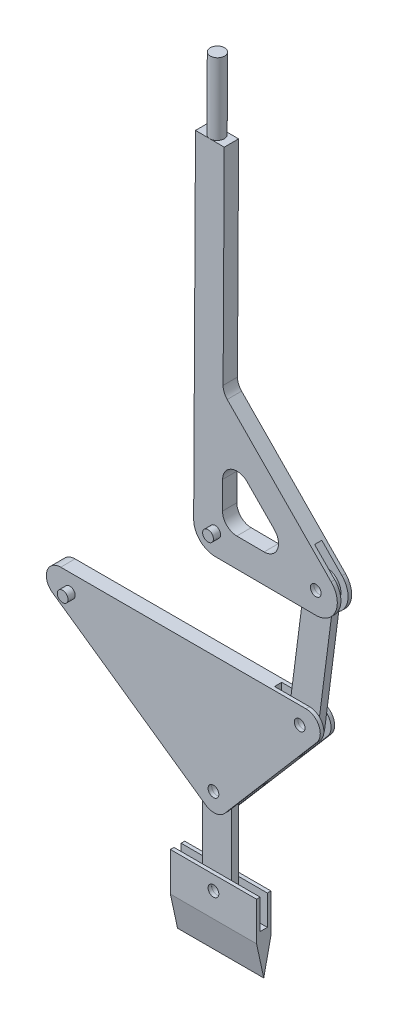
ISO-10303-21;
HEADER;
FILE_DESCRIPTION(('STEP AP214'),'2;1');
FILE_NAME('part.step','',(''),(''),'','','');
FILE_SCHEMA(('AUTOMOTIVE_DESIGN { 1 0 10303 214 1 1 1 1 }'));
ENDSEC;
DATA;
#1=APPLICATION_CONTEXT('core data for automotive mechanical design processes');
#2=APPLICATION_PROTOCOL_DEFINITION('international standard','automotive_design',2000,#1);
#3=PRODUCT_CONTEXT('',#1,'mechanical');
#4=PRODUCT('Part','Part','',(#3));
#5=PRODUCT_RELATED_PRODUCT_CATEGORY('part','',(#4));
#6=PRODUCT_DEFINITION_FORMATION('','',#4);
#7=PRODUCT_DEFINITION_CONTEXT('part definition',#1,'design');
#8=PRODUCT_DEFINITION('design','',#6,#7);
#9=PRODUCT_DEFINITION_SHAPE('','',#8);
#10=(LENGTH_UNIT() NAMED_UNIT(*) SI_UNIT(.MILLI.,.METRE.));
#11=(NAMED_UNIT(*) PLANE_ANGLE_UNIT() SI_UNIT($,.RADIAN.));
#12=(NAMED_UNIT(*) SI_UNIT($,.STERADIAN.) SOLID_ANGLE_UNIT());
#13=UNCERTAINTY_MEASURE_WITH_UNIT(LENGTH_MEASURE(1.E-05),#10,'distance_accuracy_value','');
#14=(GEOMETRIC_REPRESENTATION_CONTEXT(3) GLOBAL_UNCERTAINTY_ASSIGNED_CONTEXT((#13)) GLOBAL_UNIT_ASSIGNED_CONTEXT((#10,
#11,#12)) REPRESENTATION_CONTEXT('',''));
#15=CARTESIAN_POINT('',(0.,0.,0.));
#16=DIRECTION('',(0.,0.,1.));
#17=DIRECTION('',(1.,0.,0.));
#18=AXIS2_PLACEMENT_3D('',#15,#16,#17);
#19=CARTESIAN_POINT('',(257.059737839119,221.408093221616,25.4));
#20=DIRECTION('',(0.,0.,-1.));
#21=DIRECTION('',(-1.,0.,0.));
#22=AXIS2_PLACEMENT_3D('',#19,#20,#21);
#23=CYLINDRICAL_SURFACE('',#22,9.52500000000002);
#24=CARTESIAN_POINT('',(257.059737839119,221.408093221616,25.4));
#25=DIRECTION('',(0.,0.,1.));
#26=DIRECTION('',(1.,0.,0.));
#27=AXIS2_PLACEMENT_3D('',#24,#25,#26);
#28=CIRCLE('',#27,9.52500000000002);
#29=CARTESIAN_POINT('',(266.584737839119,221.408093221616,25.4));
#30=VERTEX_POINT('',#29);
#31=EDGE_CURVE('E12',#30,#30,#28,.T.);
#32=ORIENTED_EDGE('',*,*,#31,.F.);
#33=EDGE_LOOP('',(#32));
#34=FACE_BOUND('',#33,.T.);
#35=CARTESIAN_POINT('',(257.059737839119,221.408093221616,-25.4));
#36=DIRECTION('',(0.,0.,1.));
#37=DIRECTION('',(1.,0.,0.));
#38=AXIS2_PLACEMENT_3D('',#35,#36,#37);
#39=CIRCLE('',#38,9.52500000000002);
#40=CARTESIAN_POINT('',(266.584737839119,221.408093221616,-25.4));
#41=VERTEX_POINT('',#40);
#42=EDGE_CURVE('E59',#41,#41,#39,.T.);
#43=ORIENTED_EDGE('',*,*,#42,.T.);
#44=EDGE_LOOP('',(#43));
#45=FACE_BOUND('',#44,.T.);
#46=ADVANCED_FACE('F56',(#34,#45),#23,.T.);
#47=CARTESIAN_POINT('',(257.059737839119,221.408093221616,25.4));
#48=DIRECTION('',(0.,0.,1.));
#49=DIRECTION('',(1.,0.,0.));
#50=AXIS2_PLACEMENT_3D('',#47,#48,#49);
#51=PLANE('',#50);
#52=ORIENTED_EDGE('',*,*,#31,.T.);
#53=EDGE_LOOP('',(#52));
#54=FACE_BOUND('',#53,.T.);
#55=ADVANCED_FACE('F71',(#54),#51,.T.);
#56=CARTESIAN_POINT('',(257.059737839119,221.408093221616,-25.4));
#57=DIRECTION('',(0.,0.,1.));
#58=DIRECTION('',(1.,0.,0.));
#59=AXIS2_PLACEMENT_3D('',#56,#57,#58);
#60=PLANE('',#59);
#61=ORIENTED_EDGE('',*,*,#42,.F.);
#62=EDGE_LOOP('',(#61));
#63=FACE_BOUND('',#62,.T.);
#64=ADVANCED_FACE('F69',(#63),#60,.F.);
#65=CLOSED_SHELL('',(#46,#55,#64));
#66=MANIFOLD_SOLID_BREP('B2',#65);
#67=CARTESIAN_POINT('',(0.,0.,25.4));
#68=DIRECTION('',(0.,0.,-1.));
#69=DIRECTION('',(-1.,0.,0.));
#70=AXIS2_PLACEMENT_3D('',#67,#68,#69);
#71=CYLINDRICAL_SURFACE('',#70,9.525);
#72=CARTESIAN_POINT('',(0.,0.,25.4));
#73=DIRECTION('',(0.,0.,1.));
#74=DIRECTION('',(1.,0.,0.));
#75=AXIS2_PLACEMENT_3D('',#72,#73,#74);
#76=CIRCLE('',#75,9.525);
#77=CARTESIAN_POINT('',(9.525,0.,25.4));
#78=VERTEX_POINT('',#77);
#79=EDGE_CURVE('E55',#78,#78,#76,.T.);
#80=ORIENTED_EDGE('',*,*,#79,.F.);
#81=EDGE_LOOP('',(#80));
#82=FACE_BOUND('',#81,.T.);
#83=CARTESIAN_POINT('',(0.,0.,-25.4));
#84=DIRECTION('',(0.,0.,1.));
#85=DIRECTION('',(1.,0.,0.));
#86=AXIS2_PLACEMENT_3D('',#83,#84,#85);
#87=CIRCLE('',#86,9.525);
#88=CARTESIAN_POINT('',(9.525,0.,-25.4));
#89=VERTEX_POINT('',#88);
#90=EDGE_CURVE('E109',#89,#89,#87,.T.);
#91=ORIENTED_EDGE('',*,*,#90,.T.);
#92=EDGE_LOOP('',(#91));
#93=FACE_BOUND('',#92,.T.);
#94=ADVANCED_FACE('F106',(#82,#93),#71,.T.);
#95=CARTESIAN_POINT('',(0.,0.,25.4));
#96=DIRECTION('',(0.,0.,1.));
#97=DIRECTION('',(1.,0.,0.));
#98=AXIS2_PLACEMENT_3D('',#95,#96,#97);
#99=PLANE('',#98);
#100=ORIENTED_EDGE('',*,*,#79,.T.);
#101=EDGE_LOOP('',(#100));
#102=FACE_BOUND('',#101,.T.);
#103=ADVANCED_FACE('F121',(#102),#99,.T.);
#104=CARTESIAN_POINT('',(0.,0.,-25.4));
#105=DIRECTION('',(0.,0.,1.));
#106=DIRECTION('',(1.,0.,0.));
#107=AXIS2_PLACEMENT_3D('',#104,#105,#106);
#108=PLANE('',#107);
#109=ORIENTED_EDGE('',*,*,#90,.F.);
#110=EDGE_LOOP('',(#109));
#111=FACE_BOUND('',#110,.T.);
#112=ADVANCED_FACE('F119',(#111),#108,.F.);
#113=CLOSED_SHELL('',(#94,#103,#112));
#114=MANIFOLD_SOLID_BREP('B7',#113);
#115=CARTESIAN_POINT('',(417.445040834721,5.08,12.7));
#116=DIRECTION('',(0.,0.,-1.));
#117=DIRECTION('',(-1.,0.,0.));
#118=AXIS2_PLACEMENT_3D('',#115,#116,#117);
#119=CYLINDRICAL_SURFACE('',#118,25.4);
#120=CARTESIAN_POINT('',(417.445040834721,5.08,-6.35));
#121=DIRECTION('',(0.,0.,1.));
#122=DIRECTION('',(1.,0.,0.));
#123=AXIS2_PLACEMENT_3D('',#120,#121,#122);
#124=CIRCLE('',#123,25.4);
#125=CARTESIAN_POINT('',(436.7301585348,-11.4501008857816,-6.35));
#126=VERTEX_POINT('',#125);
#127=CARTESIAN_POINT('',(417.445040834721,30.48,-6.35));
#128=VERTEX_POINT('',#127);
#129=EDGE_CURVE('E279',#126,#128,#124,.T.);
#130=ORIENTED_EDGE('',*,*,#129,.F.);
#131=DIRECTION('',(0.,0.,-1.));
#132=VECTOR('',#131,1.);
#133=CARTESIAN_POINT('',(436.7301585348,-11.4501008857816,12.7));
#134=LINE('',#133,#132);
#135=CARTESIAN_POINT('',(436.7301585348,-11.4501008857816,-12.7));
#136=VERTEX_POINT('',#135);
#137=EDGE_CURVE('E371',#126,#136,#134,.T.);
#138=ORIENTED_EDGE('',*,*,#137,.T.);
#139=CARTESIAN_POINT('',(417.445040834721,5.08,-12.7));
#140=DIRECTION('',(0.,0.,1.));
#141=DIRECTION('',(-1.,0.,0.));
#142=AXIS2_PLACEMENT_3D('',#139,#140,#141);
#143=CIRCLE('',#142,25.4);
#144=CARTESIAN_POINT('',(417.445040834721,30.48,-12.7));
#145=VERTEX_POINT('',#144);
#146=EDGE_CURVE('E354',#136,#145,#143,.T.);
#147=ORIENTED_EDGE('',*,*,#146,.T.);
#148=DIRECTION('',(0.,0.,-1.));
#149=VECTOR('',#148,1.);
#150=CARTESIAN_POINT('',(417.445040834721,30.48,12.7));
#151=LINE('',#150,#149);
#152=EDGE_CURVE('E165',#128,#145,#151,.T.);
#153=ORIENTED_EDGE('',*,*,#152,.F.);
#154=EDGE_LOOP('',(#130,#138,#147,#153));
#155=FACE_BOUND('',#154,.T.);
#156=ADVANCED_FACE('F156',(#155),#119,.T.);
#157=CARTESIAN_POINT('',(417.445040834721,30.48,12.7));
#158=DIRECTION('',(0.,-1.,0.));
#159=DIRECTION('',(1.,0.,0.));
#160=AXIS2_PLACEMENT_3D('',#157,#158,#159);
#161=PLANE('',#160);
#162=DIRECTION('',(-1.,0.,0.));
#163=VECTOR('',#162,1.);
#164=CARTESIAN_POINT('',(417.445040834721,30.48,-6.35));
#165=LINE('',#164,#163);
#166=CARTESIAN_POINT('',(355.6,30.48,-6.35));
#167=VERTEX_POINT('',#166);
#168=EDGE_CURVE('E273',#128,#167,#165,.T.);
#169=ORIENTED_EDGE('',*,*,#168,.F.);
#170=ORIENTED_EDGE('',*,*,#152,.T.);
#171=DIRECTION('',(-1.,0.,0.));
#172=VECTOR('',#171,1.);
#173=CARTESIAN_POINT('',(417.445040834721,30.48,-12.7));
#174=LINE('',#173,#172);
#175=CARTESIAN_POINT('',(-16.1156146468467,30.4799999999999,-12.7));
#176=VERTEX_POINT('',#175);
#177=EDGE_CURVE('E374',#145,#176,#174,.T.);
#178=ORIENTED_EDGE('',*,*,#177,.T.);
#179=DIRECTION('',(0.,0.,-1.));
#180=VECTOR('',#179,1.);
#181=CARTESIAN_POINT('',(-16.1156146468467,30.4799999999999,12.7));
#182=LINE('',#181,#180);
#183=CARTESIAN_POINT('',(-16.1156146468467,30.4799999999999,12.7));
#184=VERTEX_POINT('',#183);
#185=EDGE_CURVE('E400',#184,#176,#182,.T.);
#186=ORIENTED_EDGE('',*,*,#185,.F.);
#187=DIRECTION('',(-1.,0.,0.));
#188=VECTOR('',#187,1.);
#189=CARTESIAN_POINT('',(417.445040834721,30.48,12.7));
#190=LINE('',#189,#188);
#191=CARTESIAN_POINT('',(417.445040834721,30.48,12.7));
#192=VERTEX_POINT('',#191);
#193=EDGE_CURVE('E360',#192,#184,#190,.T.);
#194=ORIENTED_EDGE('',*,*,#193,.F.);
#195=CARTESIAN_POINT('',(417.445040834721,30.48,6.35));
#196=VERTEX_POINT('',#195);
#197=EDGE_CURVE('E104',#192,#196,#151,.T.);
#198=ORIENTED_EDGE('',*,*,#197,.T.);
#199=DIRECTION('',(-1.,0.,0.));
#200=VECTOR('',#199,1.);
#201=CARTESIAN_POINT('',(417.445040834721,30.48,6.35));
#202=LINE('',#201,#200);
#203=CARTESIAN_POINT('',(355.6,30.48,6.35));
#204=VERTEX_POINT('',#203);
#205=EDGE_CURVE('E297',#196,#204,#202,.T.);
#206=ORIENTED_EDGE('',*,*,#205,.T.);
#207=DIRECTION('',(0.,0.,1.));
#208=VECTOR('',#207,1.);
#209=CARTESIAN_POINT('',(355.6,30.48,-6.35));
#210=LINE('',#209,#208);
#211=EDGE_CURVE('E288',#167,#204,#210,.T.);
#212=ORIENTED_EDGE('',*,*,#211,.F.);
#213=EDGE_LOOP('',(#169,#170,#178,#186,#194,#198,#206,#212));
#214=FACE_BOUND('',#213,.T.);
#215=ADVANCED_FACE('F296',(#214),#161,.F.);
#216=CARTESIAN_POINT('',(-30.6815581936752,-15.7284907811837,12.7));
#217=DIRECTION('',(0.573462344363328,0.81923192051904,0.));
#218=DIRECTION('',(-0.81923192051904,0.573462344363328,0.));
#219=AXIS2_PLACEMENT_3D('',#216,#217,#218);
#220=PLANE('',#219);
#221=DIRECTION('',(0.81923192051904,-0.573462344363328,0.));
#222=VECTOR('',#221,1.);
#223=CARTESIAN_POINT('',(-30.6815581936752,-15.7284907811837,-6.35));
#224=LINE('',#223,#222);
#225=CARTESIAN_POINT('',(135.528296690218,-132.075389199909,-6.35));
#226=VERTEX_POINT('',#225);
#227=CARTESIAN_POINT('',(240.293851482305,-205.41127755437,-6.35));
#228=VERTEX_POINT('',#227);
#229=EDGE_CURVE('E329',#226,#228,#224,.T.);
#230=ORIENTED_EDGE('',*,*,#229,.F.);
#231=DIRECTION('',(0.,0.,1.));
#232=VECTOR('',#231,1.);
#233=CARTESIAN_POINT('',(135.528296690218,-132.075389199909,-6.35));
#234=LINE('',#233,#232);
#235=CARTESIAN_POINT('',(135.528296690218,-132.075389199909,6.35));
#236=VERTEX_POINT('',#235);
#237=EDGE_CURVE('E309',#226,#236,#234,.T.);
#238=ORIENTED_EDGE('',*,*,#237,.T.);
#239=DIRECTION('',(0.81923192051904,-0.573462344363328,0.));
#240=VECTOR('',#239,1.);
#241=CARTESIAN_POINT('',(-30.6815581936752,-15.7284907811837,6.35));
#242=LINE('',#241,#240);
#243=CARTESIAN_POINT('',(240.293851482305,-205.41127755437,6.35));
#244=VERTEX_POINT('',#243);
#245=EDGE_CURVE('E321',#236,#244,#242,.T.);
#246=ORIENTED_EDGE('',*,*,#245,.T.);
#247=DIRECTION('',(0.,0.,-1.));
#248=VECTOR('',#247,1.);
#249=CARTESIAN_POINT('',(240.293851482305,-205.41127755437,12.7));
#250=LINE('',#249,#248);
#251=CARTESIAN_POINT('',(240.293851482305,-205.41127755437,12.7));
#252=VERTEX_POINT('',#251);
#253=EDGE_CURVE('E394',#252,#244,#250,.T.);
#254=ORIENTED_EDGE('',*,*,#253,.F.);
#255=DIRECTION('',(0.81923192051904,-0.573462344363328,0.));
#256=VECTOR('',#255,1.);
#257=CARTESIAN_POINT('',(-30.6815581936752,-15.7284907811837,12.7));
#258=LINE('',#257,#256);
#259=CARTESIAN_POINT('',(-30.6815581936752,-15.7284907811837,12.7));
#260=VERTEX_POINT('',#259);
#261=EDGE_CURVE('E365',#260,#252,#258,.T.);
#262=ORIENTED_EDGE('',*,*,#261,.F.);
#263=DIRECTION('',(0.,0.,-1.));
#264=VECTOR('',#263,1.);
#265=CARTESIAN_POINT('',(-30.6815581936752,-15.7284907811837,12.7));
#266=LINE('',#265,#264);
#267=CARTESIAN_POINT('',(-30.6815581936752,-15.7284907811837,-12.7));
#268=VERTEX_POINT('',#267);
#269=EDGE_CURVE('E397',#260,#268,#266,.T.);
#270=ORIENTED_EDGE('',*,*,#269,.T.);
#271=DIRECTION('',(0.81923192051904,-0.573462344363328,0.));
#272=VECTOR('',#271,1.);
#273=CARTESIAN_POINT('',(-30.6815581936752,-15.7284907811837,-12.7));
#274=LINE('',#273,#272);
#275=CARTESIAN_POINT('',(240.293851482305,-205.41127755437,-12.7));
#276=VERTEX_POINT('',#275);
#277=EDGE_CURVE('E378',#268,#276,#274,.T.);
#278=ORIENTED_EDGE('',*,*,#277,.T.);
#279=EDGE_CURVE('E393',#228,#276,#250,.T.);
#280=ORIENTED_EDGE('',*,*,#279,.F.);
#281=EDGE_LOOP('',(#230,#238,#246,#254,#262,#270,#278,#280));
#282=FACE_BOUND('',#281,.T.);
#283=ADVANCED_FACE('F449',(#282),#220,.F.);
#284=CARTESIAN_POINT('',(254.859795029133,-184.602786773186,12.7));
#285=DIRECTION('',(0.,0.,-1.));
#286=DIRECTION('',(-1.,0.,0.));
#287=AXIS2_PLACEMENT_3D('',#284,#285,#286);
#288=CYLINDRICAL_SURFACE('',#287,25.4);
#289=CARTESIAN_POINT('',(254.859795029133,-184.602786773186,-6.35));
#290=DIRECTION('',(0.,0.,1.));
#291=DIRECTION('',(1.,0.,0.));
#292=AXIS2_PLACEMENT_3D('',#289,#290,#291);
#293=CIRCLE('',#292,25.4);
#294=CARTESIAN_POINT('',(274.144912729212,-201.132887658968,-6.35));
#295=VERTEX_POINT('',#294);
#296=EDGE_CURVE('E327',#228,#295,#293,.T.);
#297=ORIENTED_EDGE('',*,*,#296,.F.);
#298=ORIENTED_EDGE('',*,*,#279,.T.);
#299=CARTESIAN_POINT('',(254.859795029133,-184.602786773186,-12.7));
#300=DIRECTION('',(0.,0.,1.));
#301=DIRECTION('',(1.,0.,0.));
#302=AXIS2_PLACEMENT_3D('',#299,#300,#301);
#303=CIRCLE('',#302,25.4);
#304=CARTESIAN_POINT('',(274.144912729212,-201.132887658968,-12.7));
#305=VERTEX_POINT('',#304);
#306=EDGE_CURVE('E381',#276,#305,#303,.T.);
#307=ORIENTED_EDGE('',*,*,#306,.T.);
#308=DIRECTION('',(0.,0.,-1.));
#309=VECTOR('',#308,1.);
#310=CARTESIAN_POINT('',(274.144912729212,-201.132887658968,12.7));
#311=LINE('',#310,#309);
#312=EDGE_CURVE('E389',#295,#305,#311,.T.);
#313=ORIENTED_EDGE('',*,*,#312,.F.);
#314=EDGE_LOOP('',(#297,#298,#307,#313));
#315=FACE_BOUND('',#314,.T.);
#316=ADVANCED_FACE('F516',(#315),#288,.T.);
#317=CARTESIAN_POINT('',(274.144912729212,-201.132887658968,12.7));
#318=DIRECTION('',(-0.759256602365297,0.650791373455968,0.));
#319=DIRECTION('',(-0.650791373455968,-0.759256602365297,0.));
#320=AXIS2_PLACEMENT_3D('',#317,#318,#319);
#321=PLANE('',#320);
#322=DIRECTION('',(0.650791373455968,0.759256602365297,0.));
#323=VECTOR('',#322,1.);
#324=CARTESIAN_POINT('',(274.144912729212,-201.132887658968,-6.35));
#325=LINE('',#324,#323);
#326=CARTESIAN_POINT('',(396.481939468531,-58.406356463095,-6.35));
#327=VERTEX_POINT('',#326);
#328=EDGE_CURVE('E336',#327,#126,#325,.T.);
#329=ORIENTED_EDGE('',*,*,#328,.F.);
#330=DIRECTION('',(0.,0.,1.));
#331=VECTOR('',#330,1.);
#332=CARTESIAN_POINT('',(396.481939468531,-58.406356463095,-6.35));
#333=LINE('',#332,#331);
#334=CARTESIAN_POINT('',(396.481939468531,-58.406356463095,6.35));
#335=VERTEX_POINT('',#334);
#336=EDGE_CURVE('E405',#327,#335,#333,.T.);
#337=ORIENTED_EDGE('',*,*,#336,.T.);
#338=DIRECTION('',(0.650791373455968,0.759256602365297,0.));
#339=VECTOR('',#338,1.);
#340=CARTESIAN_POINT('',(274.144912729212,-201.132887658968,6.35));
#341=LINE('',#340,#339);
#342=CARTESIAN_POINT('',(436.7301585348,-11.4501008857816,6.35));
#343=VERTEX_POINT('',#342);
#344=EDGE_CURVE('E332',#335,#343,#341,.T.);
#345=ORIENTED_EDGE('',*,*,#344,.T.);
#346=CARTESIAN_POINT('',(436.7301585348,-11.4501008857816,12.7));
#347=VERTEX_POINT('',#346);
#348=EDGE_CURVE('E386',#347,#343,#134,.T.);
#349=ORIENTED_EDGE('',*,*,#348,.F.);
#350=DIRECTION('',(0.650791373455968,0.759256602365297,0.));
#351=VECTOR('',#350,1.);
#352=CARTESIAN_POINT('',(274.144912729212,-201.132887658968,12.7));
#353=LINE('',#352,#351);
#354=CARTESIAN_POINT('',(274.144912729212,-201.132887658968,12.7));
#355=VERTEX_POINT('',#354);
#356=EDGE_CURVE('E369',#355,#347,#353,.T.);
#357=ORIENTED_EDGE('',*,*,#356,.F.);
#358=CARTESIAN_POINT('',(274.144912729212,-201.132887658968,6.35));
#359=VERTEX_POINT('',#358);
#360=EDGE_CURVE('E390',#355,#359,#311,.T.);
#361=ORIENTED_EDGE('',*,*,#360,.T.);
#362=DIRECTION('',(0.650791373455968,0.759256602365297,0.));
#363=VECTOR('',#362,1.);
#364=CARTESIAN_POINT('',(274.144912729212,-201.132887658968,6.35));
#365=LINE('',#364,#363);
#366=CARTESIAN_POINT('',(333.337054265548,-132.075389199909,6.35));
#367=VERTEX_POINT('',#366);
#368=EDGE_CURVE('E314',#359,#367,#365,.T.);
#369=ORIENTED_EDGE('',*,*,#368,.T.);
#370=DIRECTION('',(0.,0.,1.));
#371=VECTOR('',#370,1.);
#372=CARTESIAN_POINT('',(333.337054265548,-132.075389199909,-6.35));
#373=LINE('',#372,#371);
#374=CARTESIAN_POINT('',(333.337054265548,-132.075389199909,-6.35));
#375=VERTEX_POINT('',#374);
#376=EDGE_CURVE('E173',#375,#367,#373,.T.);
#377=ORIENTED_EDGE('',*,*,#376,.F.);
#378=DIRECTION('',(0.650791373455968,0.759256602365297,0.));
#379=VECTOR('',#378,1.);
#380=CARTESIAN_POINT('',(274.144912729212,-201.132887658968,-6.35));
#381=LINE('',#380,#379);
#382=EDGE_CURVE('E325',#295,#375,#381,.T.);
#383=ORIENTED_EDGE('',*,*,#382,.F.);
#384=ORIENTED_EDGE('',*,*,#312,.T.);
#385=DIRECTION('',(0.650791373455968,0.759256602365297,0.));
#386=VECTOR('',#385,1.);
#387=CARTESIAN_POINT('',(274.144912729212,-201.132887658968,-12.7));
#388=LINE('',#387,#386);
#389=EDGE_CURVE('E361',#305,#136,#388,.T.);
#390=ORIENTED_EDGE('',*,*,#389,.T.);
#391=ORIENTED_EDGE('',*,*,#137,.F.);
#392=EDGE_LOOP('',(#329,#337,#345,#349,#357,#361,#369,#377,#383,#384,#390,#391));
#393=FACE_BOUND('',#392,.T.);
#394=ADVANCED_FACE('F468',(#393),#321,.F.);
#395=CARTESIAN_POINT('',(406.4,0.,12.7));
#396=DIRECTION('',(0.,0.,-1.));
#397=DIRECTION('',(-1.,0.,0.));
#398=AXIS2_PLACEMENT_3D('',#395,#396,#397);
#399=CYLINDRICAL_SURFACE('',#398,9.52500000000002);
#400=CARTESIAN_POINT('',(406.4,0.,-12.7));
#401=DIRECTION('',(0.,0.,1.));
#402=DIRECTION('',(1.,0.,0.));
#403=AXIS2_PLACEMENT_3D('',#400,#401,#402);
#404=CIRCLE('',#403,9.52500000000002);
#405=CARTESIAN_POINT('',(415.925,0.,-12.7));
#406=VERTEX_POINT('',#405);
#407=EDGE_CURVE('E342',#406,#406,#404,.T.);
#408=ORIENTED_EDGE('',*,*,#407,.F.);
#409=EDGE_LOOP('',(#408));
#410=FACE_BOUND('',#409,.T.);
#411=CARTESIAN_POINT('',(406.4,0.,-6.35));
#412=DIRECTION('',(0.,0.,1.));
#413=DIRECTION('',(1.,0.,0.));
#414=AXIS2_PLACEMENT_3D('',#411,#412,#413);
#415=CIRCLE('',#414,9.52500000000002);
#416=CARTESIAN_POINT('',(415.925,0.,-6.35));
#417=VERTEX_POINT('',#416);
#418=EDGE_CURVE('E160',#417,#417,#415,.T.);
#419=ORIENTED_EDGE('',*,*,#418,.T.);
#420=EDGE_LOOP('',(#419));
#421=FACE_BOUND('',#420,.T.);
#422=ADVANCED_FACE('F418',(#410,#421),#399,.F.);
#423=CARTESIAN_POINT('',(254.,-177.8,12.7));
#424=DIRECTION('',(0.,0.,-1.));
#425=DIRECTION('',(-1.,0.,0.));
#426=AXIS2_PLACEMENT_3D('',#423,#424,#425);
#427=CYLINDRICAL_SURFACE('',#426,9.52500000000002);
#428=CARTESIAN_POINT('',(254.,-177.8,-12.7));
#429=DIRECTION('',(0.,0.,1.));
#430=DIRECTION('',(1.,0.,0.));
#431=AXIS2_PLACEMENT_3D('',#428,#429,#430);
#432=CIRCLE('',#431,9.52500000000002);
#433=CARTESIAN_POINT('',(263.525,-177.8,-12.7));
#434=VERTEX_POINT('',#433);
#435=EDGE_CURVE('E283',#434,#434,#432,.T.);
#436=ORIENTED_EDGE('',*,*,#435,.F.);
#437=EDGE_LOOP('',(#436));
#438=FACE_BOUND('',#437,.T.);
#439=CARTESIAN_POINT('',(254.,-177.8,-6.35));
#440=DIRECTION('',(0.,0.,1.));
#441=DIRECTION('',(1.,0.,0.));
#442=AXIS2_PLACEMENT_3D('',#439,#440,#441);
#443=CIRCLE('',#442,9.52500000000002);
#444=CARTESIAN_POINT('',(263.525,-177.8,-6.35));
#445=VERTEX_POINT('',#444);
#446=EDGE_CURVE('E324',#445,#445,#443,.T.);
#447=ORIENTED_EDGE('',*,*,#446,.T.);
#448=EDGE_LOOP('',(#447));
#449=FACE_BOUND('',#448,.T.);
#450=ADVANCED_FACE('F425',(#438,#449),#427,.F.);
#451=CARTESIAN_POINT('',(417.445040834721,5.08,12.7));
#452=DIRECTION('',(0.,0.,-1.));
#453=DIRECTION('',(-1.,0.,0.));
#454=AXIS2_PLACEMENT_3D('',#451,#452,#453);
#455=PLANE('',#454);
#456=CARTESIAN_POINT('',(417.445040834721,5.08,12.7));
#457=DIRECTION('',(0.,0.,1.));
#458=DIRECTION('',(-1.,0.,0.));
#459=AXIS2_PLACEMENT_3D('',#456,#457,#458);
#460=CIRCLE('',#459,25.4);
#461=EDGE_CURVE('E357',#347,#192,#460,.T.);
#462=ORIENTED_EDGE('',*,*,#461,.T.);
#463=ORIENTED_EDGE('',*,*,#193,.T.);
#464=CARTESIAN_POINT('',(-16.1156146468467,5.07999999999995,12.7));
#465=DIRECTION('',(0.,0.,1.));
#466=DIRECTION('',(1.,0.,0.));
#467=AXIS2_PLACEMENT_3D('',#464,#465,#466);
#468=CIRCLE('',#467,25.4);
#469=EDGE_CURVE('E363',#184,#260,#468,.T.);
#470=ORIENTED_EDGE('',*,*,#469,.T.);
#471=ORIENTED_EDGE('',*,*,#261,.T.);
#472=CARTESIAN_POINT('',(254.859795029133,-184.602786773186,12.7));
#473=DIRECTION('',(0.,0.,1.));
#474=DIRECTION('',(1.,0.,0.));
#475=AXIS2_PLACEMENT_3D('',#472,#473,#474);
#476=CIRCLE('',#475,25.4);
#477=EDGE_CURVE('E367',#252,#355,#476,.T.);
#478=ORIENTED_EDGE('',*,*,#477,.T.);
#479=ORIENTED_EDGE('',*,*,#356,.T.);
#480=EDGE_LOOP('',(#462,#463,#470,#471,#478,#479));
#481=FACE_BOUND('',#480,.T.);
#482=CARTESIAN_POINT('',(0.,0.,12.7));
#483=DIRECTION('',(0.,0.,1.));
#484=DIRECTION('',(1.,0.,0.));
#485=AXIS2_PLACEMENT_3D('',#482,#483,#484);
#486=CIRCLE('',#485,9.525);
#487=CARTESIAN_POINT('',(9.525,0.,12.7));
#488=VERTEX_POINT('',#487);
#489=EDGE_CURVE('E351',#488,#488,#486,.T.);
#490=ORIENTED_EDGE('',*,*,#489,.F.);
#491=EDGE_LOOP('',(#490));
#492=FACE_BOUND('',#491,.T.);
#493=CARTESIAN_POINT('',(406.4,0.,12.7));
#494=DIRECTION('',(0.,0.,1.));
#495=DIRECTION('',(1.,0.,0.));
#496=AXIS2_PLACEMENT_3D('',#493,#494,#495);
#497=CIRCLE('',#496,9.52500000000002);
#498=CARTESIAN_POINT('',(415.925,0.,12.7));
#499=VERTEX_POINT('',#498);
#500=EDGE_CURVE('E345',#499,#499,#497,.T.);
#501=ORIENTED_EDGE('',*,*,#500,.F.);
#502=EDGE_LOOP('',(#501));
#503=FACE_BOUND('',#502,.T.);
#504=CARTESIAN_POINT('',(254.,-177.8,12.7));
#505=DIRECTION('',(0.,0.,1.));
#506=DIRECTION('',(1.,0.,0.));
#507=AXIS2_PLACEMENT_3D('',#504,#505,#506);
#508=CIRCLE('',#507,9.52500000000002);
#509=CARTESIAN_POINT('',(263.525,-177.8,12.7));
#510=VERTEX_POINT('',#509);
#511=EDGE_CURVE('E339',#510,#510,#508,.T.);
#512=ORIENTED_EDGE('',*,*,#511,.F.);
#513=EDGE_LOOP('',(#512));
#514=FACE_BOUND('',#513,.T.);
#515=ADVANCED_FACE('F421',(#481,#492,#503,#514),#455,.F.);
#516=CARTESIAN_POINT('',(417.445040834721,5.08,-12.7));
#517=DIRECTION('',(0.,0.,-1.));
#518=DIRECTION('',(-1.,0.,0.));
#519=AXIS2_PLACEMENT_3D('',#516,#517,#518);
#520=PLANE('',#519);
#521=ORIENTED_EDGE('',*,*,#407,.T.);
#522=EDGE_LOOP('',(#521));
#523=FACE_BOUND('',#522,.T.);
#524=ORIENTED_EDGE('',*,*,#146,.F.);
#525=ORIENTED_EDGE('',*,*,#389,.F.);
#526=ORIENTED_EDGE('',*,*,#306,.F.);
#527=ORIENTED_EDGE('',*,*,#277,.F.);
#528=CARTESIAN_POINT('',(-16.1156146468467,5.07999999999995,-12.7));
#529=DIRECTION('',(0.,0.,1.));
#530=DIRECTION('',(1.,0.,0.));
#531=AXIS2_PLACEMENT_3D('',#528,#529,#530);
#532=CIRCLE('',#531,25.4);
#533=EDGE_CURVE('E376',#176,#268,#532,.T.);
#534=ORIENTED_EDGE('',*,*,#533,.F.);
#535=ORIENTED_EDGE('',*,*,#177,.F.);
#536=EDGE_LOOP('',(#524,#525,#526,#527,#534,#535));
#537=FACE_BOUND('',#536,.T.);
#538=CARTESIAN_POINT('',(0.,0.,-12.7));
#539=DIRECTION('',(0.,0.,1.));
#540=DIRECTION('',(1.,0.,0.));
#541=AXIS2_PLACEMENT_3D('',#538,#539,#540);
#542=CIRCLE('',#541,9.525);
#543=CARTESIAN_POINT('',(9.525,0.,-12.7));
#544=VERTEX_POINT('',#543);
#545=EDGE_CURVE('E348',#544,#544,#542,.T.);
#546=ORIENTED_EDGE('',*,*,#545,.T.);
#547=EDGE_LOOP('',(#546));
#548=FACE_BOUND('',#547,.T.);
#549=ORIENTED_EDGE('',*,*,#435,.T.);
#550=EDGE_LOOP('',(#549));
#551=FACE_BOUND('',#550,.T.);
#552=ADVANCED_FACE('F424',(#523,#537,#548,#551),#520,.T.);
#553=ORIENTED_EDGE('',*,*,#348,.T.);
#554=CARTESIAN_POINT('',(417.445040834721,5.08,6.35));
#555=DIRECTION('',(0.,0.,1.));
#556=DIRECTION('',(1.,0.,0.));
#557=AXIS2_PLACEMENT_3D('',#554,#555,#556);
#558=CIRCLE('',#557,25.4);
#559=EDGE_CURVE('E181',#343,#196,#558,.T.);
#560=ORIENTED_EDGE('',*,*,#559,.T.);
#561=ORIENTED_EDGE('',*,*,#197,.F.);
#562=ORIENTED_EDGE('',*,*,#461,.F.);
#563=EDGE_LOOP('',(#553,#560,#561,#562));
#564=FACE_BOUND('',#563,.T.);
#565=ADVANCED_FACE('F158',(#564),#119,.T.);
#566=CARTESIAN_POINT('',(-16.1156146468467,5.07999999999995,12.7));
#567=DIRECTION('',(0.,0.,-1.));
#568=DIRECTION('',(-1.,0.,0.));
#569=AXIS2_PLACEMENT_3D('',#566,#567,#568);
#570=CYLINDRICAL_SURFACE('',#569,25.4);
#571=ORIENTED_EDGE('',*,*,#533,.T.);
#572=ORIENTED_EDGE('',*,*,#269,.F.);
#573=ORIENTED_EDGE('',*,*,#469,.F.);
#574=ORIENTED_EDGE('',*,*,#185,.T.);
#575=EDGE_LOOP('',(#571,#572,#573,#574));
#576=FACE_BOUND('',#575,.T.);
#577=ADVANCED_FACE('F451',(#576),#570,.T.);
#578=ORIENTED_EDGE('',*,*,#253,.T.);
#579=CARTESIAN_POINT('',(254.859795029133,-184.602786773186,6.35));
#580=DIRECTION('',(0.,0.,1.));
#581=DIRECTION('',(1.,0.,0.));
#582=AXIS2_PLACEMENT_3D('',#579,#580,#581);
#583=CIRCLE('',#582,25.4);
#584=EDGE_CURVE('E317',#244,#359,#583,.T.);
#585=ORIENTED_EDGE('',*,*,#584,.T.);
#586=ORIENTED_EDGE('',*,*,#360,.F.);
#587=ORIENTED_EDGE('',*,*,#477,.F.);
#588=EDGE_LOOP('',(#578,#585,#586,#587));
#589=FACE_BOUND('',#588,.T.);
#590=ADVANCED_FACE('F457',(#589),#288,.T.);
#591=CARTESIAN_POINT('',(0.,0.,12.7));
#592=DIRECTION('',(0.,0.,-1.));
#593=DIRECTION('',(-1.,0.,0.));
#594=AXIS2_PLACEMENT_3D('',#591,#592,#593);
#595=CYLINDRICAL_SURFACE('',#594,9.525);
#596=ORIENTED_EDGE('',*,*,#489,.T.);
#597=EDGE_LOOP('',(#596));
#598=FACE_BOUND('',#597,.T.);
#599=ORIENTED_EDGE('',*,*,#545,.F.);
#600=EDGE_LOOP('',(#599));
#601=FACE_BOUND('',#600,.T.);
#602=ADVANCED_FACE('F416',(#598,#601),#595,.F.);
#603=CARTESIAN_POINT('',(406.4,0.,6.35));
#604=DIRECTION('',(0.,0.,1.));
#605=DIRECTION('',(1.,0.,0.));
#606=AXIS2_PLACEMENT_3D('',#603,#604,#605);
#607=CIRCLE('',#606,9.52500000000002);
#608=CARTESIAN_POINT('',(415.925,0.,6.35));
#609=VERTEX_POINT('',#608);
#610=EDGE_CURVE('E331',#609,#609,#607,.T.);
#611=ORIENTED_EDGE('',*,*,#610,.F.);
#612=EDGE_LOOP('',(#611));
#613=FACE_BOUND('',#612,.T.);
#614=ORIENTED_EDGE('',*,*,#500,.T.);
#615=EDGE_LOOP('',(#614));
#616=FACE_BOUND('',#615,.T.);
#617=ADVANCED_FACE('F412',(#613,#616),#399,.F.);
#618=CARTESIAN_POINT('',(254.,-177.8,6.35));
#619=DIRECTION('',(0.,0.,1.));
#620=DIRECTION('',(1.,0.,0.));
#621=AXIS2_PLACEMENT_3D('',#618,#619,#620);
#622=CIRCLE('',#621,9.52500000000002);
#623=CARTESIAN_POINT('',(263.525,-177.8,6.35));
#624=VERTEX_POINT('',#623);
#625=EDGE_CURVE('E318',#624,#624,#622,.T.);
#626=ORIENTED_EDGE('',*,*,#625,.F.);
#627=EDGE_LOOP('',(#626));
#628=FACE_BOUND('',#627,.T.);
#629=ORIENTED_EDGE('',*,*,#511,.T.);
#630=EDGE_LOOP('',(#629));
#631=FACE_BOUND('',#630,.T.);
#632=ADVANCED_FACE('F415',(#628,#631),#427,.F.);
#633=CARTESIAN_POINT('',(0.,0.,-6.35));
#634=DIRECTION('',(0.,0.,1.));
#635=DIRECTION('',(1.,0.,0.));
#636=AXIS2_PLACEMENT_3D('',#633,#634,#635);
#637=PLANE('',#636);
#638=ORIENTED_EDGE('',*,*,#446,.F.);
#639=EDGE_LOOP('',(#638));
#640=FACE_BOUND('',#639,.T.);
#641=ORIENTED_EDGE('',*,*,#229,.T.);
#642=ORIENTED_EDGE('',*,*,#296,.T.);
#643=ORIENTED_EDGE('',*,*,#382,.T.);
#644=DIRECTION('',(1.,0.,0.));
#645=VECTOR('',#644,1.);
#646=CARTESIAN_POINT('',(0.,-132.075389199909,-6.35));
#647=LINE('',#646,#645);
#648=EDGE_CURVE('E305',#226,#375,#647,.T.);
#649=ORIENTED_EDGE('',*,*,#648,.F.);
#650=EDGE_LOOP('',(#641,#642,#643,#649));
#651=FACE_BOUND('',#650,.T.);
#652=ADVANCED_FACE('F431',(#640,#651),#637,.T.);
#653=CARTESIAN_POINT('',(0.,0.,6.35));
#654=DIRECTION('',(0.,0.,1.));
#655=DIRECTION('',(1.,0.,0.));
#656=AXIS2_PLACEMENT_3D('',#653,#654,#655);
#657=PLANE('',#656);
#658=ORIENTED_EDGE('',*,*,#625,.T.);
#659=EDGE_LOOP('',(#658));
#660=FACE_BOUND('',#659,.T.);
#661=DIRECTION('',(1.,0.,0.));
#662=VECTOR('',#661,1.);
#663=CARTESIAN_POINT('',(0.,-132.075389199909,6.35));
#664=LINE('',#663,#662);
#665=EDGE_CURVE('E307',#236,#367,#664,.T.);
#666=ORIENTED_EDGE('',*,*,#665,.T.);
#667=ORIENTED_EDGE('',*,*,#368,.F.);
#668=ORIENTED_EDGE('',*,*,#584,.F.);
#669=ORIENTED_EDGE('',*,*,#245,.F.);
#670=EDGE_LOOP('',(#666,#667,#668,#669));
#671=FACE_BOUND('',#670,.T.);
#672=ADVANCED_FACE('F437',(#660,#671),#657,.F.);
#673=CARTESIAN_POINT('',(0.,-132.075389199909,-6.35));
#674=DIRECTION('',(0.,-1.,0.));
#675=DIRECTION('',(0.,0.,-1.));
#676=AXIS2_PLACEMENT_3D('',#673,#674,#675);
#677=PLANE('',#676);
#678=ORIENTED_EDGE('',*,*,#665,.F.);
#679=ORIENTED_EDGE('',*,*,#237,.F.);
#680=ORIENTED_EDGE('',*,*,#648,.T.);
#681=ORIENTED_EDGE('',*,*,#376,.T.);
#682=EDGE_LOOP('',(#678,#679,#680,#681));
#683=FACE_BOUND('',#682,.T.);
#684=ADVANCED_FACE('F497',(#683),#677,.T.);
#685=CARTESIAN_POINT('',(0.,0.,-6.35));
#686=DIRECTION('',(0.,0.,1.));
#687=DIRECTION('',(1.,0.,0.));
#688=AXIS2_PLACEMENT_3D('',#685,#686,#687);
#689=PLANE('',#688);
#690=ORIENTED_EDGE('',*,*,#418,.F.);
#691=EDGE_LOOP('',(#690));
#692=FACE_BOUND('',#691,.T.);
#693=ORIENTED_EDGE('',*,*,#168,.T.);
#694=DIRECTION('',(0.,-1.,0.));
#695=VECTOR('',#694,1.);
#696=CARTESIAN_POINT('',(355.6,-6.47630097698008E-13,-6.35));
#697=LINE('',#696,#695);
#698=CARTESIAN_POINT('',(355.6,0.,-6.35));
#699=VERTEX_POINT('',#698);
#700=EDGE_CURVE('E277',#167,#699,#697,.T.);
#701=ORIENTED_EDGE('',*,*,#700,.T.);
#702=CARTESIAN_POINT('',(406.4,0.,-6.35));
#703=DIRECTION('',(0.,0.,1.));
#704=DIRECTION('',(1.,0.,0.));
#705=AXIS2_PLACEMENT_3D('',#702,#703,#704);
#706=CIRCLE('',#705,50.8);
#707=CARTESIAN_POINT('',(373.339798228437,-38.5702354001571,-6.35));
#708=VERTEX_POINT('',#707);
#709=EDGE_CURVE('E292',#699,#708,#706,.T.);
#710=ORIENTED_EDGE('',*,*,#709,.T.);
#711=DIRECTION('',(-0.759256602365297,0.650791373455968,0.));
#712=VECTOR('',#711,1.);
#713=CARTESIAN_POINT('',(139.062151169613,162.239176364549,-6.35));
#714=LINE('',#713,#712);
#715=EDGE_CURVE('E298',#327,#708,#714,.T.);
#716=ORIENTED_EDGE('',*,*,#715,.F.);
#717=ORIENTED_EDGE('',*,*,#328,.T.);
#718=ORIENTED_EDGE('',*,*,#129,.T.);
#719=EDGE_LOOP('',(#693,#701,#710,#716,#717,#718));
#720=FACE_BOUND('',#719,.T.);
#721=ADVANCED_FACE('F275',(#692,#720),#689,.T.);
#722=CARTESIAN_POINT('',(0.,0.,6.35));
#723=DIRECTION('',(0.,0.,1.));
#724=DIRECTION('',(1.,0.,0.));
#725=AXIS2_PLACEMENT_3D('',#722,#723,#724);
#726=PLANE('',#725);
#727=ORIENTED_EDGE('',*,*,#610,.T.);
#728=EDGE_LOOP('',(#727));
#729=FACE_BOUND('',#728,.T.);
#730=ORIENTED_EDGE('',*,*,#559,.F.);
#731=ORIENTED_EDGE('',*,*,#344,.F.);
#732=DIRECTION('',(-0.759256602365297,0.650791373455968,0.));
#733=VECTOR('',#732,1.);
#734=CARTESIAN_POINT('',(139.062151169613,162.239176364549,6.35));
#735=LINE('',#734,#733);
#736=CARTESIAN_POINT('',(373.339798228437,-38.5702354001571,6.35));
#737=VERTEX_POINT('',#736);
#738=EDGE_CURVE('E293',#335,#737,#735,.T.);
#739=ORIENTED_EDGE('',*,*,#738,.T.);
#740=CARTESIAN_POINT('',(406.4,0.,6.35));
#741=DIRECTION('',(0.,0.,1.));
#742=DIRECTION('',(1.,0.,0.));
#743=AXIS2_PLACEMENT_3D('',#740,#741,#742);
#744=CIRCLE('',#743,50.8);
#745=CARTESIAN_POINT('',(355.6,0.,6.35));
#746=VERTEX_POINT('',#745);
#747=EDGE_CURVE('E478',#746,#737,#744,.T.);
#748=ORIENTED_EDGE('',*,*,#747,.F.);
#749=DIRECTION('',(0.,-1.,0.));
#750=VECTOR('',#749,1.);
#751=CARTESIAN_POINT('',(355.6,-6.47630097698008E-13,6.35));
#752=LINE('',#751,#750);
#753=EDGE_CURVE('E312',#204,#746,#752,.T.);
#754=ORIENTED_EDGE('',*,*,#753,.F.);
#755=ORIENTED_EDGE('',*,*,#205,.F.);
#756=EDGE_LOOP('',(#730,#731,#739,#748,#754,#755));
#757=FACE_BOUND('',#756,.T.);
#758=ADVANCED_FACE('F410',(#729,#757),#726,.F.);
#759=CARTESIAN_POINT('',(139.062151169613,162.239176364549,-6.35));
#760=DIRECTION('',(0.650791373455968,0.759256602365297,0.));
#761=DIRECTION('',(-0.759256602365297,0.650791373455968,0.));
#762=AXIS2_PLACEMENT_3D('',#759,#760,#761);
#763=PLANE('',#762);
#764=ORIENTED_EDGE('',*,*,#738,.F.);
#765=ORIENTED_EDGE('',*,*,#336,.F.);
#766=ORIENTED_EDGE('',*,*,#715,.T.);
#767=DIRECTION('',(0.,0.,1.));
#768=VECTOR('',#767,1.);
#769=CARTESIAN_POINT('',(373.339798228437,-38.5702354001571,-6.35));
#770=LINE('',#769,#768);
#771=EDGE_CURVE('E300',#708,#737,#770,.T.);
#772=ORIENTED_EDGE('',*,*,#771,.T.);
#773=EDGE_LOOP('',(#764,#765,#766,#772));
#774=FACE_BOUND('',#773,.T.);
#775=ADVANCED_FACE('F475',(#774),#763,.T.);
#776=CARTESIAN_POINT('',(406.4,0.,-6.35));
#777=DIRECTION('',(0.,0.,1.));
#778=DIRECTION('',(1.,0.,0.));
#779=AXIS2_PLACEMENT_3D('',#776,#777,#778);
#780=CYLINDRICAL_SURFACE('',#779,50.8);
#781=ORIENTED_EDGE('',*,*,#747,.T.);
#782=ORIENTED_EDGE('',*,*,#771,.F.);
#783=ORIENTED_EDGE('',*,*,#709,.F.);
#784=DIRECTION('',(0.,0.,1.));
#785=VECTOR('',#784,1.);
#786=CARTESIAN_POINT('',(355.6,0.,-6.35));
#787=LINE('',#786,#785);
#788=EDGE_CURVE('E290',#699,#746,#787,.T.);
#789=ORIENTED_EDGE('',*,*,#788,.T.);
#790=EDGE_LOOP('',(#781,#782,#783,#789));
#791=FACE_BOUND('',#790,.T.);
#792=ADVANCED_FACE('F485',(#791),#780,.F.);
#793=CARTESIAN_POINT('',(355.6,-6.47630097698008E-13,-6.35));
#794=DIRECTION('',(-1.,0.,0.));
#795=DIRECTION('',(0.,-1.,0.));
#796=AXIS2_PLACEMENT_3D('',#793,#794,#795);
#797=PLANE('',#796);
#798=ORIENTED_EDGE('',*,*,#753,.T.);
#799=ORIENTED_EDGE('',*,*,#788,.F.);
#800=ORIENTED_EDGE('',*,*,#700,.F.);
#801=ORIENTED_EDGE('',*,*,#211,.T.);
#802=EDGE_LOOP('',(#798,#799,#800,#801));
#803=FACE_BOUND('',#802,.T.);
#804=ADVANCED_FACE('F287',(#803),#797,.F.);
#805=CLOSED_SHELL('',(#156,#215,#283,#316,#394,#422,#450,#515,#552,#565,#577,#590,#602,#617,
#632,#652,#672,#684,#721,#758,#775,#792,#804));
#806=MANIFOLD_SOLID_BREP('B50',#805);
#807=CARTESIAN_POINT('',(359.062031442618,352.13946195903,12.7));
#808=DIRECTION('',(0.713955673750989,0.700190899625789,0.));
#809=DIRECTION('',(-0.700190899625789,0.713955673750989,0.));
#810=AXIS2_PLACEMENT_3D('',#807,#808,#809);
#811=PLANE('',#810);
#812=DIRECTION('',(0.,0.,1.));
#813=VECTOR('',#812,1.);
#814=CARTESIAN_POINT('',(426.491751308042,283.384168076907,-6.35));
#815=LINE('',#814,#813);
#816=CARTESIAN_POINT('',(426.491751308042,283.384168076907,-6.35));
#817=VERTEX_POINT('',#816);
#818=CARTESIAN_POINT('',(426.491751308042,283.384168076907,6.35));
#819=VERTEX_POINT('',#818);
#820=EDGE_CURVE('E870',#817,#819,#815,.T.);
#821=ORIENTED_EDGE('',*,*,#820,.F.);
#822=DIRECTION('',(0.700190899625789,-0.713955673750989,0.));
#823=VECTOR('',#822,1.);
#824=CARTESIAN_POINT('',(359.062031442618,352.13946195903,-6.35));
#825=LINE('',#824,#823);
#826=CARTESIAN_POINT('',(462.061449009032,247.115219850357,-6.35));
#827=VERTEX_POINT('',#826);
#828=EDGE_CURVE('E853',#817,#827,#825,.T.);
#829=ORIENTED_EDGE('',*,*,#828,.T.);
#830=DIRECTION('',(0.,0.,-1.));
#831=VECTOR('',#830,1.);
#832=CARTESIAN_POINT('',(462.061449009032,247.115219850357,12.7));
#833=LINE('',#832,#831);
#834=CARTESIAN_POINT('',(462.061449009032,247.115219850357,-12.7));
#835=VERTEX_POINT('',#834);
#836=EDGE_CURVE('E996',#827,#835,#833,.T.);
#837=ORIENTED_EDGE('',*,*,#836,.T.);
#838=DIRECTION('',(0.700190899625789,-0.713955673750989,0.));
#839=VECTOR('',#838,1.);
#840=CARTESIAN_POINT('',(359.062031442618,352.13946195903,-12.7));
#841=LINE('',#840,#839);
#842=CARTESIAN_POINT('',(278.285606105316,434.503838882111,-12.7));
#843=VERTEX_POINT('',#842);
#844=EDGE_CURVE('E969',#843,#835,#841,.T.);
#845=ORIENTED_EDGE('',*,*,#844,.F.);
#846=DIRECTION('',(0.,0.,-1.));
#847=VECTOR('',#846,1.);
#848=CARTESIAN_POINT('',(278.285606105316,434.503838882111,12.7));
#849=LINE('',#848,#847);
#850=CARTESIAN_POINT('',(278.285606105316,434.503838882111,12.7));
#851=VERTEX_POINT('',#850);
#852=EDGE_CURVE('E1013',#851,#843,#849,.T.);
#853=ORIENTED_EDGE('',*,*,#852,.F.);
#854=DIRECTION('',(0.700190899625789,-0.713955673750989,0.));
#855=VECTOR('',#854,1.);
#856=CARTESIAN_POINT('',(359.062031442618,352.13946195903,12.7));
#857=LINE('',#856,#855);
#858=CARTESIAN_POINT('',(462.061449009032,247.115219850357,12.7));
#859=VERTEX_POINT('',#858);
#860=EDGE_CURVE('E923',#851,#859,#857,.T.);
#861=ORIENTED_EDGE('',*,*,#860,.T.);
#862=CARTESIAN_POINT('',(462.061449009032,247.115219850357,6.35));
#863=VERTEX_POINT('',#862);
#864=EDGE_CURVE('E993',#859,#863,#833,.T.);
#865=ORIENTED_EDGE('',*,*,#864,.T.);
#866=DIRECTION('',(0.700190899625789,-0.713955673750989,0.));
#867=VECTOR('',#866,1.);
#868=CARTESIAN_POINT('',(359.062031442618,352.13946195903,6.35));
#869=LINE('',#868,#867);
#870=EDGE_CURVE('E725',#819,#863,#869,.T.);
#871=ORIENTED_EDGE('',*,*,#870,.F.);
#872=EDGE_LOOP('',(#821,#829,#837,#845,#853,#861,#865,#871));
#873=FACE_BOUND('',#872,.T.);
#874=ADVANCED_FACE('F710',(#873),#811,.T.);
#875=CARTESIAN_POINT('',(1.00782110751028,184.704645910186,12.7));
#876=DIRECTION('',(0.00545631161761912,0.999985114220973,0.));
#877=DIRECTION('',(-0.999985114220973,0.00545631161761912,0.));
#878=AXIS2_PLACEMENT_3D('',#875,#876,#877);
#879=PLANE('',#878);
#880=DIRECTION('',(0.999985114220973,-0.00545631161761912,0.));
#881=VECTOR('',#880,1.);
#882=CARTESIAN_POINT('',(1.00782110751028,184.704645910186,-6.35));
#883=LINE('',#882,#881);
#884=CARTESIAN_POINT('',(383.85336475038,182.615690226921,-6.35));
#885=VERTEX_POINT('',#884);
#886=CARTESIAN_POINT('',(434.651852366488,182.338513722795,-6.35));
#887=VERTEX_POINT('',#886);
#888=EDGE_CURVE('E864',#885,#887,#883,.T.);
#889=ORIENTED_EDGE('',*,*,#888,.F.);
#890=DIRECTION('',(0.,0.,1.));
#891=VECTOR('',#890,1.);
#892=CARTESIAN_POINT('',(383.85336475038,182.615690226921,-6.35));
#893=LINE('',#892,#891);
#894=CARTESIAN_POINT('',(383.85336475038,182.615690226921,6.35));
#895=VERTEX_POINT('',#894);
#896=EDGE_CURVE('E886',#885,#895,#893,.T.);
#897=ORIENTED_EDGE('',*,*,#896,.T.);
#898=DIRECTION('',(0.999985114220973,-0.00545631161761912,0.));
#899=VECTOR('',#898,1.);
#900=CARTESIAN_POINT('',(1.00782110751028,184.704645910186,6.35));
#901=LINE('',#900,#899);
#902=CARTESIAN_POINT('',(434.651852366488,182.338513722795,6.35));
#903=VERTEX_POINT('',#902);
#904=EDGE_CURVE('E883',#895,#903,#901,.T.);
#905=ORIENTED_EDGE('',*,*,#904,.T.);
#906=DIRECTION('',(0.,0.,-1.));
#907=VECTOR('',#906,1.);
#908=CARTESIAN_POINT('',(434.651852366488,182.338513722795,12.7));
#909=LINE('',#908,#907);
#910=CARTESIAN_POINT('',(434.651852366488,182.338513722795,12.7));
#911=VERTEX_POINT('',#910);
#912=EDGE_CURVE('E997',#911,#903,#909,.T.);
#913=ORIENTED_EDGE('',*,*,#912,.F.);
#914=DIRECTION('',(0.999985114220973,-0.00545631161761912,0.));
#915=VECTOR('',#914,1.);
#916=CARTESIAN_POINT('',(1.00782110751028,184.704645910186,12.7));
#917=LINE('',#916,#915);
#918=CARTESIAN_POINT('',(256.851852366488,183.308660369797,12.7));
#919=VERTEX_POINT('',#918);
#920=EDGE_CURVE('E941',#919,#911,#917,.T.);
#921=ORIENTED_EDGE('',*,*,#920,.F.);
#922=DIRECTION('',(0.,0.,-1.));
#923=VECTOR('',#922,1.);
#924=CARTESIAN_POINT('',(256.851852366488,183.308660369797,12.7));
#925=LINE('',#924,#923);
#926=CARTESIAN_POINT('',(256.851852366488,183.308660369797,-12.7));
#927=VERTEX_POINT('',#926);
#928=EDGE_CURVE('E1000',#919,#927,#925,.T.);
#929=ORIENTED_EDGE('',*,*,#928,.T.);
#930=DIRECTION('',(0.999985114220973,-0.00545631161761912,0.));
#931=VECTOR('',#930,1.);
#932=CARTESIAN_POINT('',(1.00782110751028,184.704645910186,-12.7));
#933=LINE('',#932,#931);
#934=CARTESIAN_POINT('',(434.651852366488,182.338513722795,-12.7));
#935=VERTEX_POINT('',#934);
#936=EDGE_CURVE('E988',#927,#935,#933,.T.);
#937=ORIENTED_EDGE('',*,*,#936,.T.);
#938=EDGE_CURVE('E995',#887,#935,#909,.T.);
#939=ORIENTED_EDGE('',*,*,#938,.F.);
#940=EDGE_LOOP('',(#889,#897,#905,#913,#921,#929,#937,#939));
#941=FACE_BOUND('',#940,.T.);
#942=ADVANCED_FACE('F1054',(#941),#879,.F.);
#943=CARTESIAN_POINT('',(434.859737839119,220.437946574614,12.7));
#944=DIRECTION('',(0.,0.,-1.));
#945=DIRECTION('',(-1.,0.,0.));
#946=AXIS2_PLACEMENT_3D('',#943,#944,#945);
#947=CYLINDRICAL_SURFACE('',#946,9.52500000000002);
#948=CARTESIAN_POINT('',(434.859737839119,220.437946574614,-12.7));
#949=DIRECTION('',(0.,0.,1.));
#950=DIRECTION('',(1.,0.,0.));
#951=AXIS2_PLACEMENT_3D('',#948,#949,#950);
#952=CIRCLE('',#951,9.52500000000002);
#953=CARTESIAN_POINT('',(444.384737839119,220.437946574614,-12.7));
#954=VERTEX_POINT('',#953);
#955=EDGE_CURVE('E966',#954,#954,#952,.T.);
#956=ORIENTED_EDGE('',*,*,#955,.F.);
#957=EDGE_LOOP('',(#956));
#958=FACE_BOUND('',#957,.T.);
#959=CARTESIAN_POINT('',(434.859737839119,220.437946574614,-6.35));
#960=DIRECTION('',(0.,0.,1.));
#961=DIRECTION('',(1.,0.,0.));
#962=AXIS2_PLACEMENT_3D('',#959,#960,#961);
#963=CIRCLE('',#962,9.52500000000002);
#964=CARTESIAN_POINT('',(444.384737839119,220.437946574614,-6.35));
#965=VERTEX_POINT('',#964);
#966=EDGE_CURVE('E863',#965,#965,#963,.T.);
#967=ORIENTED_EDGE('',*,*,#966,.T.);
#968=EDGE_LOOP('',(#967));
#969=FACE_BOUND('',#968,.T.);
#970=ADVANCED_FACE('F1101',(#958,#969),#947,.F.);
#971=CARTESIAN_POINT('',(434.859737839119,220.437946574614,12.7));
#972=DIRECTION('',(0.,0.,-1.));
#973=DIRECTION('',(-1.,0.,0.));
#974=AXIS2_PLACEMENT_3D('',#971,#972,#973);
#975=CYLINDRICAL_SURFACE('',#974,38.0999999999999);
#976=CARTESIAN_POINT('',(434.859737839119,220.437946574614,-6.35));
#977=DIRECTION('',(0.,0.,1.));
#978=DIRECTION('',(1.,0.,0.));
#979=AXIS2_PLACEMENT_3D('',#976,#977,#978);
#980=CIRCLE('',#979,38.0999999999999);
#981=EDGE_CURVE('E154',#887,#827,#980,.T.);
#982=ORIENTED_EDGE('',*,*,#981,.F.);
#983=ORIENTED_EDGE('',*,*,#938,.T.);
#984=CARTESIAN_POINT('',(434.859737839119,220.437946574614,-12.7));
#985=DIRECTION('',(0.,0.,1.));
#986=DIRECTION('',(1.,0.,0.));
#987=AXIS2_PLACEMENT_3D('',#984,#985,#986);
#988=CIRCLE('',#987,38.0999999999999);
#989=EDGE_CURVE('E905',#935,#835,#988,.T.);
#990=ORIENTED_EDGE('',*,*,#989,.T.);
#991=ORIENTED_EDGE('',*,*,#836,.F.);
#992=EDGE_LOOP('',(#982,#983,#990,#991));
#993=FACE_BOUND('',#992,.T.);
#994=ADVANCED_FACE('F1067',(#993),#975,.T.);
#995=CARTESIAN_POINT('',(4.47257898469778,819.695193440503,12.7));
#996=DIRECTION('',(0.00545631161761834,0.999985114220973,0.));
#997=DIRECTION('',(-0.999985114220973,0.00545631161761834,0.));
#998=AXIS2_PLACEMENT_3D('',#995,#996,#997);
#999=PLANE('',#998);
#1000=CARTESIAN_POINT('',(247.61679929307,818.368503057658,0.));
#1001=DIRECTION('',(0.00545631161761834,0.999985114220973,0.));
#1002=DIRECTION('',(-0.999985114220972,0.00545631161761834,0.));
#1003=AXIS2_PLACEMENT_3D('',#1000,#1001,#1002);
#1004=CIRCLE('',#1003,12.7);
#1005=CARTESIAN_POINT('',(247.61679929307,818.368503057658,12.7));
#1006=VERTEX_POINT('',#1005);
#1007=CARTESIAN_POINT('',(247.61679929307,818.368503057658,-12.7));
#1008=VERTEX_POINT('',#1007);
#1009=EDGE_CURVE('E894',#1006,#1008,#1004,.T.);
#1010=ORIENTED_EDGE('',*,*,#1009,.F.);
#1011=DIRECTION('',(0.999985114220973,-0.00545631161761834,0.));
#1012=VECTOR('',#1011,1.);
#1013=CARTESIAN_POINT('',(4.47257898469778,819.695193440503,12.7));
#1014=LINE('',#1013,#1012);
#1015=CARTESIAN_POINT('',(273.016421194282,818.22991274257,12.7));
#1016=VERTEX_POINT('',#1015);
#1017=EDGE_CURVE('E932',#1006,#1016,#1014,.T.);
#1018=ORIENTED_EDGE('',*,*,#1017,.T.);
#1019=DIRECTION('',(0.,0.,-1.));
#1020=VECTOR('',#1019,1.);
#1021=CARTESIAN_POINT('',(273.016421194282,818.22991274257,12.7));
#1022=LINE('',#1021,#1020);
#1023=CARTESIAN_POINT('',(273.016421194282,818.22991274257,-12.7));
#1024=VERTEX_POINT('',#1023);
#1025=EDGE_CURVE('E1007',#1016,#1024,#1022,.T.);
#1026=ORIENTED_EDGE('',*,*,#1025,.T.);
#1027=DIRECTION('',(0.999985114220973,-0.00545631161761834,0.));
#1028=VECTOR('',#1027,1.);
#1029=CARTESIAN_POINT('',(4.47257898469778,819.695193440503,-12.7));
#1030=LINE('',#1029,#1028);
#1031=EDGE_CURVE('E978',#1008,#1024,#1030,.T.);
#1032=ORIENTED_EDGE('',*,*,#1031,.F.);
#1033=EDGE_LOOP('',(#1010,#1018,#1026,#1032));
#1034=FACE_BOUND('',#1033,.T.);
#1035=ADVANCED_FACE('F1032',(#1034),#999,.T.);
#1036=CARTESIAN_POINT('',(296.420080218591,452.288687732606,12.7));
#1037=DIRECTION('',(0.,0.,-1.));
#1038=DIRECTION('',(-1.,0.,0.));
#1039=AXIS2_PLACEMENT_3D('',#1036,#1037,#1038);
#1040=CYLINDRICAL_SURFACE('',#1039,25.4);
#1041=CARTESIAN_POINT('',(296.420080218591,452.288687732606,-12.7));
#1042=DIRECTION('',(0.,0.,1.));
#1043=DIRECTION('',(1.,0.,0.));
#1044=AXIS2_PLACEMENT_3D('',#1041,#1042,#1043);
#1045=CIRCLE('',#1044,25.4);
#1046=CARTESIAN_POINT('',(271.020458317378,452.427278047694,-12.7));
#1047=VERTEX_POINT('',#1046);
#1048=EDGE_CURVE('E972',#843,#1047,#1045,.F.);
#1049=ORIENTED_EDGE('',*,*,#1048,.T.);
#1050=DIRECTION('',(0.,0.,-1.));
#1051=VECTOR('',#1050,1.);
#1052=CARTESIAN_POINT('',(271.020458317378,452.427278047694,12.7));
#1053=LINE('',#1052,#1051);
#1054=CARTESIAN_POINT('',(271.020458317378,452.427278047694,12.7));
#1055=VERTEX_POINT('',#1054);
#1056=EDGE_CURVE('E1010',#1055,#1047,#1053,.T.);
#1057=ORIENTED_EDGE('',*,*,#1056,.F.);
#1058=CARTESIAN_POINT('',(296.420080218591,452.288687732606,12.7));
#1059=DIRECTION('',(0.,0.,1.));
#1060=DIRECTION('',(1.,0.,0.));
#1061=AXIS2_PLACEMENT_3D('',#1058,#1059,#1060);
#1062=CIRCLE('',#1061,25.4);
#1063=EDGE_CURVE('E926',#851,#1055,#1062,.F.);
#1064=ORIENTED_EDGE('',*,*,#1063,.F.);
#1065=ORIENTED_EDGE('',*,*,#852,.T.);
#1066=EDGE_LOOP('',(#1049,#1057,#1064,#1065));
#1067=FACE_BOUND('',#1066,.T.);
#1068=ADVANCED_FACE('F1061',(#1067),#1040,.F.);
#1069=CARTESIAN_POINT('',(268.543842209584,-1.46528069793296,12.7));
#1070=DIRECTION('',(-0.999985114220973,0.00545631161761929,0.));
#1071=DIRECTION('',(-0.00545631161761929,-0.999985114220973,0.));
#1072=AXIS2_PLACEMENT_3D('',#1069,#1070,#1071);
#1073=PLANE('',#1072);
#1074=DIRECTION('',(0.00545631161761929,0.999985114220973,0.));
#1075=VECTOR('',#1074,1.);
#1076=CARTESIAN_POINT('',(268.543842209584,-1.46528069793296,-12.7));
#1077=LINE('',#1076,#1075);
#1078=EDGE_CURVE('E975',#1047,#1024,#1077,.T.);
#1079=ORIENTED_EDGE('',*,*,#1078,.T.);
#1080=ORIENTED_EDGE('',*,*,#1025,.F.);
#1081=DIRECTION('',(0.00545631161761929,0.999985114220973,0.));
#1082=VECTOR('',#1081,1.);
#1083=CARTESIAN_POINT('',(268.543842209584,-1.46528069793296,12.7));
#1084=LINE('',#1083,#1082);
#1085=EDGE_CURVE('E929',#1055,#1016,#1084,.T.);
#1086=ORIENTED_EDGE('',*,*,#1085,.F.);
#1087=ORIENTED_EDGE('',*,*,#1056,.T.);
#1088=EDGE_LOOP('',(#1079,#1080,#1086,#1087));
#1089=FACE_BOUND('',#1088,.T.);
#1090=ADVANCED_FACE('F1064',(#1089),#1073,.F.);
#1091=EDGE_CURVE('E733',#1008,#1006,#1004,.T.);
#1092=ORIENTED_EDGE('',*,*,#1091,.F.);
#1093=CARTESIAN_POINT('',(222.217177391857,818.507093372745,-12.7));
#1094=VERTEX_POINT('',#1093);
#1095=EDGE_CURVE('E979',#1094,#1008,#1030,.T.);
#1096=ORIENTED_EDGE('',*,*,#1095,.F.);
#1097=DIRECTION('',(0.,0.,-1.));
#1098=VECTOR('',#1097,1.);
#1099=CARTESIAN_POINT('',(222.217177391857,818.507093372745,12.7));
#1100=LINE('',#1099,#1098);
#1101=CARTESIAN_POINT('',(222.217177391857,818.507093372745,12.7));
#1102=VERTEX_POINT('',#1101);
#1103=EDGE_CURVE('E1005',#1102,#1094,#1100,.T.);
#1104=ORIENTED_EDGE('',*,*,#1103,.F.);
#1105=EDGE_CURVE('E933',#1102,#1006,#1014,.T.);
#1106=ORIENTED_EDGE('',*,*,#1105,.T.);
#1107=EDGE_LOOP('',(#1092,#1096,#1104,#1106));
#1108=FACE_BOUND('',#1107,.T.);
#1109=ADVANCED_FACE('F1039',(#1108),#999,.T.);
#1110=CARTESIAN_POINT('',(217.744598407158,-1.18810006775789,12.7));
#1111=DIRECTION('',(-0.999985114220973,0.00545631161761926,0.));
#1112=DIRECTION('',(-0.00545631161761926,-0.999985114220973,0.));
#1113=AXIS2_PLACEMENT_3D('',#1110,#1111,#1112);
#1114=PLANE('',#1113);
#1115=DIRECTION('',(0.00545631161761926,0.999985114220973,0.));
#1116=VECTOR('',#1115,1.);
#1117=CARTESIAN_POINT('',(217.744598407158,-1.18810006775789,-12.7));
#1118=LINE('',#1117,#1116);
#1119=CARTESIAN_POINT('',(218.9603049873,221.615978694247,-12.7));
#1120=VERTEX_POINT('',#1119);
#1121=EDGE_CURVE('E982',#1120,#1094,#1118,.T.);
#1122=ORIENTED_EDGE('',*,*,#1121,.F.);
#1123=DIRECTION('',(0.,0.,-1.));
#1124=VECTOR('',#1123,1.);
#1125=CARTESIAN_POINT('',(218.9603049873,221.615978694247,12.7));
#1126=LINE('',#1125,#1124);
#1127=CARTESIAN_POINT('',(218.9603049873,221.615978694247,12.7));
#1128=VERTEX_POINT('',#1127);
#1129=EDGE_CURVE('E1003',#1128,#1120,#1126,.T.);
#1130=ORIENTED_EDGE('',*,*,#1129,.F.);
#1131=DIRECTION('',(0.00545631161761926,0.999985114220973,0.));
#1132=VECTOR('',#1131,1.);
#1133=CARTESIAN_POINT('',(217.744598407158,-1.18810006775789,12.7));
#1134=LINE('',#1133,#1132);
#1135=EDGE_CURVE('E935',#1128,#1102,#1134,.T.);
#1136=ORIENTED_EDGE('',*,*,#1135,.T.);
#1137=ORIENTED_EDGE('',*,*,#1103,.T.);
#1138=EDGE_LOOP('',(#1122,#1130,#1136,#1137));
#1139=FACE_BOUND('',#1138,.T.);
#1140=ADVANCED_FACE('F1046',(#1139),#1114,.T.);
#1141=CARTESIAN_POINT('',(257.059737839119,221.408093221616,12.7));
#1142=DIRECTION('',(0.,0.,-1.));
#1143=DIRECTION('',(-1.,0.,0.));
#1144=AXIS2_PLACEMENT_3D('',#1141,#1142,#1143);
#1145=CYLINDRICAL_SURFACE('',#1144,38.1);
#1146=CARTESIAN_POINT('',(257.059737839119,221.408093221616,-12.7));
#1147=DIRECTION('',(0.,0.,1.));
#1148=DIRECTION('',(1.,0.,0.));
#1149=AXIS2_PLACEMENT_3D('',#1146,#1147,#1148);
#1150=CIRCLE('',#1149,38.1);
#1151=EDGE_CURVE('E985',#1120,#927,#1150,.T.);
#1152=ORIENTED_EDGE('',*,*,#1151,.T.);
#1153=ORIENTED_EDGE('',*,*,#928,.F.);
#1154=CARTESIAN_POINT('',(257.059737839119,221.408093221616,12.7));
#1155=DIRECTION('',(0.,0.,1.));
#1156=DIRECTION('',(1.,0.,0.));
#1157=AXIS2_PLACEMENT_3D('',#1154,#1155,#1156);
#1158=CIRCLE('',#1157,38.1);
#1159=EDGE_CURVE('E938',#1128,#919,#1158,.T.);
#1160=ORIENTED_EDGE('',*,*,#1159,.F.);
#1161=ORIENTED_EDGE('',*,*,#1129,.T.);
#1162=EDGE_LOOP('',(#1152,#1153,#1160,#1161));
#1163=FACE_BOUND('',#1162,.T.);
#1164=ADVANCED_FACE('F1050',(#1163),#1145,.T.);
#1165=CARTESIAN_POINT('',(295.632720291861,307.988240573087,12.7));
#1166=DIRECTION('',(0.,0.,-1.));
#1167=DIRECTION('',(-1.,0.,0.));
#1168=AXIS2_PLACEMENT_3D('',#1165,#1166,#1167);
#1169=CYLINDRICAL_SURFACE('',#1168,25.4);
#1170=CARTESIAN_POINT('',(295.632720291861,307.988240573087,-12.7));
#1171=DIRECTION('',(0.,0.,1.));
#1172=DIRECTION('',(1.,0.,0.));
#1173=AXIS2_PLACEMENT_3D('',#1170,#1171,#1172);
#1174=CIRCLE('',#1173,25.4);
#1175=CARTESIAN_POINT('',(313.767194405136,325.773089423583,-12.7));
#1176=VERTEX_POINT('',#1175);
#1177=CARTESIAN_POINT('',(270.233098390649,308.126830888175,-12.7));
#1178=VERTEX_POINT('',#1177);
#1179=EDGE_CURVE('E898',#1176,#1178,#1174,.T.);
#1180=ORIENTED_EDGE('',*,*,#1179,.F.);
#1181=DIRECTION('',(0.,0.,-1.));
#1182=VECTOR('',#1181,1.);
#1183=CARTESIAN_POINT('',(313.767194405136,325.773089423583,12.7));
#1184=LINE('',#1183,#1182);
#1185=CARTESIAN_POINT('',(313.767194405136,325.773089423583,12.7));
#1186=VERTEX_POINT('',#1185);
#1187=EDGE_CURVE('E1025',#1186,#1176,#1184,.T.);
#1188=ORIENTED_EDGE('',*,*,#1187,.F.);
#1189=CARTESIAN_POINT('',(295.632720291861,307.988240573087,12.7));
#1190=DIRECTION('',(0.,0.,1.));
#1191=DIRECTION('',(1.,0.,0.));
#1192=AXIS2_PLACEMENT_3D('',#1189,#1190,#1191);
#1193=CIRCLE('',#1192,25.4);
#1194=CARTESIAN_POINT('',(270.233098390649,308.126830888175,12.7));
#1195=VERTEX_POINT('',#1194);
#1196=EDGE_CURVE('E901',#1186,#1195,#1193,.T.);
#1197=ORIENTED_EDGE('',*,*,#1196,.T.);
#1198=DIRECTION('',(0.,0.,-1.));
#1199=VECTOR('',#1198,1.);
#1200=CARTESIAN_POINT('',(270.233098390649,308.126830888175,12.7));
#1201=LINE('',#1200,#1199);
#1202=EDGE_CURVE('E946',#1195,#1178,#1201,.T.);
#1203=ORIENTED_EDGE('',*,*,#1202,.T.);
#1204=EDGE_LOOP('',(#1180,#1188,#1197,#1203));
#1205=FACE_BOUND('',#1204,.T.);
#1206=ADVANCED_FACE('F712',(#1205),#1169,.F.);
#1207=CARTESIAN_POINT('',(322.793083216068,316.569764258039,12.7));
#1208=DIRECTION('',(0.71395567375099,0.700190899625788,0.));
#1209=DIRECTION('',(-0.700190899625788,0.71395567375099,0.));
#1210=AXIS2_PLACEMENT_3D('',#1207,#1208,#1209);
#1211=PLANE('',#1210);
#1212=DIRECTION('',(0.700190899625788,-0.71395567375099,0.));
#1213=VECTOR('',#1212,1.);
#1214=CARTESIAN_POINT('',(322.793083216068,316.569764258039,-12.7));
#1215=LINE('',#1214,#1213);
#1216=CARTESIAN_POINT('',(361.775421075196,276.821088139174,-12.7));
#1217=VERTEX_POINT('',#1216);
#1218=EDGE_CURVE('E949',#1176,#1217,#1215,.T.);
#1219=ORIENTED_EDGE('',*,*,#1218,.T.);
#1220=DIRECTION('',(0.,0.,-1.));
#1221=VECTOR('',#1220,1.);
#1222=CARTESIAN_POINT('',(361.775421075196,276.821088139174,12.7));
#1223=LINE('',#1222,#1221);
#1224=CARTESIAN_POINT('',(361.775421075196,276.821088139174,12.7));
#1225=VERTEX_POINT('',#1224);
#1226=EDGE_CURVE('E1022',#1225,#1217,#1223,.T.);
#1227=ORIENTED_EDGE('',*,*,#1226,.F.);
#1228=DIRECTION('',(0.700190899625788,-0.71395567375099,0.));
#1229=VECTOR('',#1228,1.);
#1230=CARTESIAN_POINT('',(322.793083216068,316.569764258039,12.7));
#1231=LINE('',#1230,#1229);
#1232=EDGE_CURVE('E904',#1186,#1225,#1231,.T.);
#1233=ORIENTED_EDGE('',*,*,#1232,.F.);
#1234=ORIENTED_EDGE('',*,*,#1187,.T.);
#1235=EDGE_LOOP('',(#1219,#1227,#1233,#1234));
#1236=FACE_BOUND('',#1235,.T.);
#1237=ADVANCED_FACE('F1128',(#1236),#1211,.F.);
#1238=CARTESIAN_POINT('',(343.640946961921,259.036239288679,12.7));
#1239=DIRECTION('',(0.,0.,-1.));
#1240=DIRECTION('',(-1.,0.,0.));
#1241=AXIS2_PLACEMENT_3D('',#1238,#1239,#1240);
#1242=CYLINDRICAL_SURFACE('',#1241,25.4);
#1243=CARTESIAN_POINT('',(343.640946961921,259.036239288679,-12.7));
#1244=DIRECTION('',(0.,0.,1.));
#1245=DIRECTION('',(1.,0.,0.));
#1246=AXIS2_PLACEMENT_3D('',#1243,#1244,#1245);
#1247=CIRCLE('',#1246,25.4);
#1248=CARTESIAN_POINT('',(343.502356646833,233.636617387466,-12.7));
#1249=VERTEX_POINT('',#1248);
#1250=EDGE_CURVE('E951',#1217,#1249,#1247,.F.);
#1251=ORIENTED_EDGE('',*,*,#1250,.T.);
#1252=DIRECTION('',(0.,0.,-1.));
#1253=VECTOR('',#1252,1.);
#1254=CARTESIAN_POINT('',(343.502356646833,233.636617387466,12.7));
#1255=LINE('',#1254,#1253);
#1256=CARTESIAN_POINT('',(343.502356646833,233.636617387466,12.7));
#1257=VERTEX_POINT('',#1256);
#1258=EDGE_CURVE('E1020',#1257,#1249,#1255,.T.);
#1259=ORIENTED_EDGE('',*,*,#1258,.F.);
#1260=CARTESIAN_POINT('',(343.640946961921,259.036239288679,12.7));
#1261=DIRECTION('',(0.,0.,1.));
#1262=DIRECTION('',(1.,0.,0.));
#1263=AXIS2_PLACEMENT_3D('',#1260,#1261,#1262);
#1264=CIRCLE('',#1263,25.4);
#1265=EDGE_CURVE('E907',#1225,#1257,#1264,.F.);
#1266=ORIENTED_EDGE('',*,*,#1265,.F.);
#1267=ORIENTED_EDGE('',*,*,#1226,.T.);
#1268=EDGE_LOOP('',(#1251,#1259,#1266,#1267));
#1269=FACE_BOUND('',#1268,.T.);
#1270=ADVANCED_FACE('F1125',(#1269),#1242,.F.);
#1271=CARTESIAN_POINT('',(1.28500173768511,235.503889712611,12.7));
#1272=DIRECTION('',(0.00545631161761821,0.999985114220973,0.));
#1273=DIRECTION('',(-0.999985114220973,0.00545631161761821,0.));
#1274=AXIS2_PLACEMENT_3D('',#1271,#1272,#1273);
#1275=PLANE('',#1274);
#1276=DIRECTION('',(0.999985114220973,-0.00545631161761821,0.));
#1277=VECTOR('',#1276,1.);
#1278=CARTESIAN_POINT('',(1.28500173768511,235.503889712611,-12.7));
#1279=LINE('',#1278,#1277);
#1280=CARTESIAN_POINT('',(295.228465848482,233.900018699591,-12.7));
#1281=VERTEX_POINT('',#1280);
#1282=EDGE_CURVE('E954',#1281,#1249,#1279,.T.);
#1283=ORIENTED_EDGE('',*,*,#1282,.F.);
#1284=DIRECTION('',(0.,0.,-1.));
#1285=VECTOR('',#1284,1.);
#1286=CARTESIAN_POINT('',(295.228465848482,233.900018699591,12.7));
#1287=LINE('',#1286,#1285);
#1288=CARTESIAN_POINT('',(295.228465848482,233.900018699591,12.7));
#1289=VERTEX_POINT('',#1288);
#1290=EDGE_CURVE('E1018',#1289,#1281,#1287,.T.);
#1291=ORIENTED_EDGE('',*,*,#1290,.F.);
#1292=DIRECTION('',(0.999985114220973,-0.00545631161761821,0.));
#1293=VECTOR('',#1292,1.);
#1294=CARTESIAN_POINT('',(1.28500173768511,235.503889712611,12.7));
#1295=LINE('',#1294,#1293);
#1296=EDGE_CURVE('E909',#1289,#1257,#1295,.T.);
#1297=ORIENTED_EDGE('',*,*,#1296,.T.);
#1298=ORIENTED_EDGE('',*,*,#1258,.T.);
#1299=EDGE_LOOP('',(#1283,#1291,#1297,#1298));
#1300=FACE_BOUND('',#1299,.T.);
#1301=ADVANCED_FACE('F1121',(#1300),#1275,.T.);
#1302=CARTESIAN_POINT('',(295.367056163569,259.299640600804,12.7));
#1303=DIRECTION('',(0.,0.,-1.));
#1304=DIRECTION('',(-1.,0.,0.));
#1305=AXIS2_PLACEMENT_3D('',#1302,#1303,#1304);
#1306=CYLINDRICAL_SURFACE('',#1305,25.4);
#1307=CARTESIAN_POINT('',(295.367056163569,259.299640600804,-12.7));
#1308=DIRECTION('',(0.,0.,1.));
#1309=DIRECTION('',(1.,0.,0.));
#1310=AXIS2_PLACEMENT_3D('',#1307,#1308,#1309);
#1311=CIRCLE('',#1310,25.4);
#1312=CARTESIAN_POINT('',(269.967434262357,259.438230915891,-12.7));
#1313=VERTEX_POINT('',#1312);
#1314=EDGE_CURVE('E957',#1313,#1281,#1311,.T.);
#1315=ORIENTED_EDGE('',*,*,#1314,.F.);
#1316=DIRECTION('',(0.,0.,-1.));
#1317=VECTOR('',#1316,1.);
#1318=CARTESIAN_POINT('',(269.967434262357,259.438230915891,12.7));
#1319=LINE('',#1318,#1317);
#1320=CARTESIAN_POINT('',(269.967434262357,259.438230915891,12.7));
#1321=VERTEX_POINT('',#1320);
#1322=EDGE_CURVE('E1016',#1321,#1313,#1319,.T.);
#1323=ORIENTED_EDGE('',*,*,#1322,.F.);
#1324=CARTESIAN_POINT('',(295.367056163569,259.299640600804,12.7));
#1325=DIRECTION('',(0.,0.,1.));
#1326=DIRECTION('',(1.,0.,0.));
#1327=AXIS2_PLACEMENT_3D('',#1324,#1325,#1326);
#1328=CIRCLE('',#1327,25.4);
#1329=EDGE_CURVE('E912',#1321,#1289,#1328,.T.);
#1330=ORIENTED_EDGE('',*,*,#1329,.T.);
#1331=ORIENTED_EDGE('',*,*,#1290,.T.);
#1332=EDGE_LOOP('',(#1315,#1323,#1330,#1331));
#1333=FACE_BOUND('',#1332,.T.);
#1334=ADVANCED_FACE('F1110',(#1333),#1306,.F.);
#1335=CARTESIAN_POINT('',(434.859737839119,220.437946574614,6.35));
#1336=DIRECTION('',(0.,0.,1.));
#1337=DIRECTION('',(1.,0.,0.));
#1338=AXIS2_PLACEMENT_3D('',#1335,#1336,#1337);
#1339=CIRCLE('',#1338,9.52500000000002);
#1340=CARTESIAN_POINT('',(444.384737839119,220.437946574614,6.35));
#1341=VERTEX_POINT('',#1340);
#1342=EDGE_CURVE('E888',#1341,#1341,#1339,.T.);
#1343=ORIENTED_EDGE('',*,*,#1342,.F.);
#1344=EDGE_LOOP('',(#1343));
#1345=FACE_BOUND('',#1344,.T.);
#1346=CARTESIAN_POINT('',(434.859737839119,220.437946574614,12.7));
#1347=DIRECTION('',(0.,0.,1.));
#1348=DIRECTION('',(1.,0.,0.));
#1349=AXIS2_PLACEMENT_3D('',#1346,#1347,#1348);
#1350=CIRCLE('',#1349,9.52500000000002);
#1351=CARTESIAN_POINT('',(444.384737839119,220.437946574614,12.7));
#1352=VERTEX_POINT('',#1351);
#1353=EDGE_CURVE('E920',#1352,#1352,#1350,.T.);
#1354=ORIENTED_EDGE('',*,*,#1353,.T.);
#1355=EDGE_LOOP('',(#1354));
#1356=FACE_BOUND('',#1355,.T.);
#1357=ADVANCED_FACE('F1106',(#1345,#1356),#947,.F.);
#1358=CARTESIAN_POINT('',(257.059737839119,221.408093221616,12.7));
#1359=DIRECTION('',(0.,0.,-1.));
#1360=DIRECTION('',(-1.,0.,0.));
#1361=AXIS2_PLACEMENT_3D('',#1358,#1359,#1360);
#1362=CYLINDRICAL_SURFACE('',#1361,9.52500000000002);
#1363=CARTESIAN_POINT('',(257.059737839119,221.408093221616,12.7));
#1364=DIRECTION('',(0.,0.,1.));
#1365=DIRECTION('',(1.,0.,0.));
#1366=AXIS2_PLACEMENT_3D('',#1363,#1364,#1365);
#1367=CIRCLE('',#1366,9.52500000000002);
#1368=CARTESIAN_POINT('',(266.584737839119,221.408093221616,12.7));
#1369=VERTEX_POINT('',#1368);
#1370=EDGE_CURVE('E917',#1369,#1369,#1367,.T.);
#1371=ORIENTED_EDGE('',*,*,#1370,.T.);
#1372=EDGE_LOOP('',(#1371));
#1373=FACE_BOUND('',#1372,.T.);
#1374=CARTESIAN_POINT('',(257.059737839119,221.408093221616,-12.7));
#1375=DIRECTION('',(0.,0.,1.));
#1376=DIRECTION('',(1.,0.,0.));
#1377=AXIS2_PLACEMENT_3D('',#1374,#1375,#1376);
#1378=CIRCLE('',#1377,9.52500000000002);
#1379=CARTESIAN_POINT('',(266.584737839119,221.408093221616,-12.7));
#1380=VERTEX_POINT('',#1379);
#1381=EDGE_CURVE('E963',#1380,#1380,#1378,.T.);
#1382=ORIENTED_EDGE('',*,*,#1381,.F.);
#1383=EDGE_LOOP('',(#1382));
#1384=FACE_BOUND('',#1383,.T.);
#1385=ADVANCED_FACE('F1109',(#1373,#1384),#1362,.F.);
#1386=CARTESIAN_POINT('',(268.543842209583,-1.46528069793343,12.7));
#1387=DIRECTION('',(-0.999985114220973,0.00545631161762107,0.));
#1388=DIRECTION('',(-0.00545631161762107,-0.999985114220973,0.));
#1389=AXIS2_PLACEMENT_3D('',#1386,#1387,#1388);
#1390=PLANE('',#1389);
#1391=DIRECTION('',(0.00545631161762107,0.999985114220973,0.));
#1392=VECTOR('',#1391,1.);
#1393=CARTESIAN_POINT('',(268.543842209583,-1.46528069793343,-12.7));
#1394=LINE('',#1393,#1392);
#1395=EDGE_CURVE('E960',#1313,#1178,#1394,.T.);
#1396=ORIENTED_EDGE('',*,*,#1395,.T.);
#1397=ORIENTED_EDGE('',*,*,#1202,.F.);
#1398=DIRECTION('',(0.00545631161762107,0.999985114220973,0.));
#1399=VECTOR('',#1398,1.);
#1400=CARTESIAN_POINT('',(268.543842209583,-1.46528069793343,12.7));
#1401=LINE('',#1400,#1399);
#1402=EDGE_CURVE('E915',#1321,#1195,#1401,.T.);
#1403=ORIENTED_EDGE('',*,*,#1402,.F.);
#1404=ORIENTED_EDGE('',*,*,#1322,.T.);
#1405=EDGE_LOOP('',(#1396,#1397,#1403,#1404));
#1406=FACE_BOUND('',#1405,.T.);
#1407=ADVANCED_FACE('F1114',(#1406),#1390,.F.);
#1408=ORIENTED_EDGE('',*,*,#912,.T.);
#1409=CARTESIAN_POINT('',(434.859737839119,220.437946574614,6.35));
#1410=DIRECTION('',(0.,0.,1.));
#1411=DIRECTION('',(1.,0.,0.));
#1412=AXIS2_PLACEMENT_3D('',#1409,#1410,#1411);
#1413=CIRCLE('',#1412,38.0999999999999);
#1414=EDGE_CURVE('E718',#903,#863,#1413,.T.);
#1415=ORIENTED_EDGE('',*,*,#1414,.T.);
#1416=ORIENTED_EDGE('',*,*,#864,.F.);
#1417=CARTESIAN_POINT('',(434.859737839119,220.437946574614,12.7));
#1418=DIRECTION('',(0.,0.,1.));
#1419=DIRECTION('',(1.,0.,0.));
#1420=AXIS2_PLACEMENT_3D('',#1417,#1418,#1419);
#1421=CIRCLE('',#1420,38.0999999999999);
#1422=EDGE_CURVE('E944',#911,#859,#1421,.T.);
#1423=ORIENTED_EDGE('',*,*,#1422,.F.);
#1424=EDGE_LOOP('',(#1408,#1415,#1416,#1423));
#1425=FACE_BOUND('',#1424,.T.);
#1426=ADVANCED_FACE('F1056',(#1425),#975,.T.);
#1427=CARTESIAN_POINT('',(0.,0.,12.7));
#1428=DIRECTION('',(0.,0.,1.));
#1429=DIRECTION('',(1.,0.,0.));
#1430=AXIS2_PLACEMENT_3D('',#1427,#1428,#1429);
#1431=PLANE('',#1430);
#1432=ORIENTED_EDGE('',*,*,#1196,.F.);
#1433=ORIENTED_EDGE('',*,*,#1232,.T.);
#1434=ORIENTED_EDGE('',*,*,#1265,.T.);
#1435=ORIENTED_EDGE('',*,*,#1296,.F.);
#1436=ORIENTED_EDGE('',*,*,#1329,.F.);
#1437=ORIENTED_EDGE('',*,*,#1402,.T.);
#1438=EDGE_LOOP('',(#1432,#1433,#1434,#1435,#1436,#1437));
#1439=FACE_BOUND('',#1438,.T.);
#1440=ORIENTED_EDGE('',*,*,#1370,.F.);
#1441=EDGE_LOOP('',(#1440));
#1442=FACE_BOUND('',#1441,.T.);
#1443=ORIENTED_EDGE('',*,*,#1353,.F.);
#1444=EDGE_LOOP('',(#1443));
#1445=FACE_BOUND('',#1444,.T.);
#1446=ORIENTED_EDGE('',*,*,#860,.F.);
#1447=ORIENTED_EDGE('',*,*,#1063,.T.);
#1448=ORIENTED_EDGE('',*,*,#1085,.T.);
#1449=ORIENTED_EDGE('',*,*,#1017,.F.);
#1450=ORIENTED_EDGE('',*,*,#1105,.F.);
#1451=ORIENTED_EDGE('',*,*,#1135,.F.);
#1452=ORIENTED_EDGE('',*,*,#1159,.T.);
#1453=ORIENTED_EDGE('',*,*,#920,.T.);
#1454=ORIENTED_EDGE('',*,*,#1422,.T.);
#1455=EDGE_LOOP('',(#1446,#1447,#1448,#1449,#1450,#1451,#1452,#1453,#1454));
#1456=FACE_BOUND('',#1455,.T.);
#1457=ADVANCED_FACE('F1045',(#1439,#1442,#1445,#1456),#1431,.T.);
#1458=CARTESIAN_POINT('',(0.,0.,-12.7));
#1459=DIRECTION('',(0.,0.,1.));
#1460=DIRECTION('',(1.,0.,0.));
#1461=AXIS2_PLACEMENT_3D('',#1458,#1459,#1460);
#1462=PLANE('',#1461);
#1463=ORIENTED_EDGE('',*,*,#1179,.T.);
#1464=ORIENTED_EDGE('',*,*,#1395,.F.);
#1465=ORIENTED_EDGE('',*,*,#1314,.T.);
#1466=ORIENTED_EDGE('',*,*,#1282,.T.);
#1467=ORIENTED_EDGE('',*,*,#1250,.F.);
#1468=ORIENTED_EDGE('',*,*,#1218,.F.);
#1469=EDGE_LOOP('',(#1463,#1464,#1465,#1466,#1467,#1468));
#1470=FACE_BOUND('',#1469,.T.);
#1471=ORIENTED_EDGE('',*,*,#1381,.T.);
#1472=EDGE_LOOP('',(#1471));
#1473=FACE_BOUND('',#1472,.T.);
#1474=ORIENTED_EDGE('',*,*,#955,.T.);
#1475=EDGE_LOOP('',(#1474));
#1476=FACE_BOUND('',#1475,.T.);
#1477=ORIENTED_EDGE('',*,*,#844,.T.);
#1478=ORIENTED_EDGE('',*,*,#989,.F.);
#1479=ORIENTED_EDGE('',*,*,#936,.F.);
#1480=ORIENTED_EDGE('',*,*,#1151,.F.);
#1481=ORIENTED_EDGE('',*,*,#1121,.T.);
#1482=ORIENTED_EDGE('',*,*,#1095,.T.);
#1483=ORIENTED_EDGE('',*,*,#1031,.T.);
#1484=ORIENTED_EDGE('',*,*,#1078,.F.);
#1485=ORIENTED_EDGE('',*,*,#1048,.F.);
#1486=EDGE_LOOP('',(#1477,#1478,#1479,#1480,#1481,#1482,#1483,#1484,#1485));
#1487=FACE_BOUND('',#1486,.T.);
#1488=ADVANCED_FACE('F1036',(#1470,#1473,#1476,#1487),#1462,.F.);
#1489=CARTESIAN_POINT('',(248.309750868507,945.366612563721,0.));
#1490=DIRECTION('',(-0.00545631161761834,-0.999985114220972,0.));
#1491=DIRECTION('',(0.999985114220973,-0.00545631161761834,0.));
#1492=AXIS2_PLACEMENT_3D('',#1489,#1490,#1491);
#1493=CYLINDRICAL_SURFACE('',#1492,12.7);
#1494=CARTESIAN_POINT('',(248.309750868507,945.366612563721,0.));
#1495=DIRECTION('',(0.00545631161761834,0.999985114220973,0.));
#1496=DIRECTION('',(-0.999985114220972,0.00545631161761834,0.));
#1497=AXIS2_PLACEMENT_3D('',#1494,#1495,#1496);
#1498=CIRCLE('',#1497,12.7);
#1499=CARTESIAN_POINT('',(235.609939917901,945.435907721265,0.));
#1500=VERTEX_POINT('',#1499);
#1501=EDGE_CURVE('E895',#1500,#1500,#1498,.T.);
#1502=ORIENTED_EDGE('',*,*,#1501,.F.);
#1503=EDGE_LOOP('',(#1502));
#1504=FACE_BOUND('',#1503,.T.);
#1505=ORIENTED_EDGE('',*,*,#1009,.T.);
#1506=ORIENTED_EDGE('',*,*,#1091,.T.);
#1507=EDGE_LOOP('',(#1505,#1506));
#1508=FACE_BOUND('',#1507,.T.);
#1509=ADVANCED_FACE('F1029',(#1504,#1508),#1493,.T.);
#1510=CARTESIAN_POINT('',(248.309750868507,945.366612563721,0.));
#1511=DIRECTION('',(0.00545631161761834,0.999985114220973,0.));
#1512=DIRECTION('',(-0.999985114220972,0.00545631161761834,0.));
#1513=AXIS2_PLACEMENT_3D('',#1510,#1511,#1512);
#1514=PLANE('',#1513);
#1515=ORIENTED_EDGE('',*,*,#1501,.T.);
#1516=EDGE_LOOP('',(#1515));
#1517=FACE_BOUND('',#1516,.T.);
#1518=ADVANCED_FACE('F1203',(#1517),#1514,.T.);
#1519=CARTESIAN_POINT('',(382.84554364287,-2.0889556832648,-6.35));
#1520=DIRECTION('',(0.999985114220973,-0.00545631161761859,0.));
#1521=DIRECTION('',(0.00545631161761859,0.999985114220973,0.));
#1522=AXIS2_PLACEMENT_3D('',#1519,#1520,#1521);
#1523=PLANE('',#1522);
#1524=DIRECTION('',(0.00545631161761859,0.999985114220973,0.));
#1525=VECTOR('',#1524,1.);
#1526=CARTESIAN_POINT('',(382.84554364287,-2.0889556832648,6.35));
#1527=LINE('',#1526,#1525);
#1528=CARTESIAN_POINT('',(384.059737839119,220.437946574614,6.35));
#1529=VERTEX_POINT('',#1528);
#1530=EDGE_CURVE('E873',#895,#1529,#1527,.T.);
#1531=ORIENTED_EDGE('',*,*,#1530,.F.);
#1532=ORIENTED_EDGE('',*,*,#896,.F.);
#1533=DIRECTION('',(0.00545631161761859,0.999985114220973,0.));
#1534=VECTOR('',#1533,1.);
#1535=CARTESIAN_POINT('',(382.84554364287,-2.0889556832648,-6.35));
#1536=LINE('',#1535,#1534);
#1537=CARTESIAN_POINT('',(384.059737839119,220.437946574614,-6.35));
#1538=VERTEX_POINT('',#1537);
#1539=EDGE_CURVE('E876',#885,#1538,#1536,.T.);
#1540=ORIENTED_EDGE('',*,*,#1539,.T.);
#1541=DIRECTION('',(0.,0.,1.));
#1542=VECTOR('',#1541,1.);
#1543=CARTESIAN_POINT('',(384.059737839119,220.437946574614,-6.35));
#1544=LINE('',#1543,#1542);
#1545=EDGE_CURVE('E878',#1538,#1529,#1544,.T.);
#1546=ORIENTED_EDGE('',*,*,#1545,.T.);
#1547=EDGE_LOOP('',(#1531,#1532,#1540,#1546));
#1548=FACE_BOUND('',#1547,.T.);
#1549=ADVANCED_FACE('F1073',(#1548),#1523,.T.);
#1550=CARTESIAN_POINT('',(434.859737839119,220.437946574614,-6.35));
#1551=DIRECTION('',(0.,0.,1.));
#1552=DIRECTION('',(1.,0.,0.));
#1553=AXIS2_PLACEMENT_3D('',#1550,#1551,#1552);
#1554=CYLINDRICAL_SURFACE('',#1553,50.8);
#1555=CARTESIAN_POINT('',(434.859737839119,220.437946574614,6.35));
#1556=DIRECTION('',(0.,0.,1.));
#1557=DIRECTION('',(1.,0.,0.));
#1558=AXIS2_PLACEMENT_3D('',#1555,#1556,#1557);
#1559=CIRCLE('',#1558,50.8);
#1560=CARTESIAN_POINT('',(399.290040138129,256.706894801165,6.35));
#1561=VERTEX_POINT('',#1560);
#1562=EDGE_CURVE('E1079',#1561,#1529,#1559,.T.);
#1563=ORIENTED_EDGE('',*,*,#1562,.T.);
#1564=ORIENTED_EDGE('',*,*,#1545,.F.);
#1565=CARTESIAN_POINT('',(434.859737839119,220.437946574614,-6.35));
#1566=DIRECTION('',(0.,0.,1.));
#1567=DIRECTION('',(1.,0.,0.));
#1568=AXIS2_PLACEMENT_3D('',#1565,#1566,#1567);
#1569=CIRCLE('',#1568,50.8);
#1570=CARTESIAN_POINT('',(399.290040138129,256.706894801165,-6.35));
#1571=VERTEX_POINT('',#1570);
#1572=EDGE_CURVE('E872',#1571,#1538,#1569,.T.);
#1573=ORIENTED_EDGE('',*,*,#1572,.F.);
#1574=DIRECTION('',(0.,0.,1.));
#1575=VECTOR('',#1574,1.);
#1576=CARTESIAN_POINT('',(399.290040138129,256.706894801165,-6.35));
#1577=LINE('',#1576,#1575);
#1578=EDGE_CURVE('E871',#1571,#1561,#1577,.T.);
#1579=ORIENTED_EDGE('',*,*,#1578,.T.);
#1580=EDGE_LOOP('',(#1563,#1564,#1573,#1579));
#1581=FACE_BOUND('',#1580,.T.);
#1582=ADVANCED_FACE('F1077',(#1581),#1554,.F.);
#1583=CARTESIAN_POINT('',(67.429719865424,-68.755293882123,-6.35));
#1584=DIRECTION('',(0.70019089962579,-0.713955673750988,0.));
#1585=DIRECTION('',(0.713955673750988,0.70019089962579,0.));
#1586=AXIS2_PLACEMENT_3D('',#1583,#1584,#1585);
#1587=PLANE('',#1586);
#1588=DIRECTION('',(0.713955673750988,0.70019089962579,0.));
#1589=VECTOR('',#1588,1.);
#1590=CARTESIAN_POINT('',(67.429719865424,-68.755293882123,6.35));
#1591=LINE('',#1590,#1589);
#1592=EDGE_CURVE('E1084',#1561,#819,#1591,.T.);
#1593=ORIENTED_EDGE('',*,*,#1592,.F.);
#1594=ORIENTED_EDGE('',*,*,#1578,.F.);
#1595=DIRECTION('',(0.713955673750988,0.70019089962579,0.));
#1596=VECTOR('',#1595,1.);
#1597=CARTESIAN_POINT('',(67.429719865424,-68.755293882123,-6.35));
#1598=LINE('',#1597,#1596);
#1599=EDGE_CURVE('E857',#1571,#817,#1598,.T.);
#1600=ORIENTED_EDGE('',*,*,#1599,.T.);
#1601=ORIENTED_EDGE('',*,*,#820,.T.);
#1602=EDGE_LOOP('',(#1593,#1594,#1600,#1601));
#1603=FACE_BOUND('',#1602,.T.);
#1604=ADVANCED_FACE('F869',(#1603),#1587,.T.);
#1605=CARTESIAN_POINT('',(0.,0.,-6.35));
#1606=DIRECTION('',(0.,0.,1.));
#1607=DIRECTION('',(1.,0.,0.));
#1608=AXIS2_PLACEMENT_3D('',#1605,#1606,#1607);
#1609=PLANE('',#1608);
#1610=ORIENTED_EDGE('',*,*,#966,.F.);
#1611=EDGE_LOOP('',(#1610));
#1612=FACE_BOUND('',#1611,.T.);
#1613=ORIENTED_EDGE('',*,*,#1599,.F.);
#1614=ORIENTED_EDGE('',*,*,#1572,.T.);
#1615=ORIENTED_EDGE('',*,*,#1539,.F.);
#1616=ORIENTED_EDGE('',*,*,#888,.T.);
#1617=ORIENTED_EDGE('',*,*,#981,.T.);
#1618=ORIENTED_EDGE('',*,*,#828,.F.);
#1619=EDGE_LOOP('',(#1613,#1614,#1615,#1616,#1617,#1618));
#1620=FACE_BOUND('',#1619,.T.);
#1621=ADVANCED_FACE('F855',(#1612,#1620),#1609,.T.);
#1622=CARTESIAN_POINT('',(0.,0.,6.35));
#1623=DIRECTION('',(0.,0.,1.));
#1624=DIRECTION('',(1.,0.,0.));
#1625=AXIS2_PLACEMENT_3D('',#1622,#1623,#1624);
#1626=PLANE('',#1625);
#1627=ORIENTED_EDGE('',*,*,#1342,.T.);
#1628=EDGE_LOOP('',(#1627));
#1629=FACE_BOUND('',#1628,.T.);
#1630=ORIENTED_EDGE('',*,*,#870,.T.);
#1631=ORIENTED_EDGE('',*,*,#1414,.F.);
#1632=ORIENTED_EDGE('',*,*,#904,.F.);
#1633=ORIENTED_EDGE('',*,*,#1530,.T.);
#1634=ORIENTED_EDGE('',*,*,#1562,.F.);
#1635=ORIENTED_EDGE('',*,*,#1592,.T.);
#1636=EDGE_LOOP('',(#1630,#1631,#1632,#1633,#1634,#1635));
#1637=FACE_BOUND('',#1636,.T.);
#1638=ADVANCED_FACE('F1086',(#1629,#1637),#1626,.F.);
#1639=CLOSED_SHELL('',(#874,#942,#970,#994,#1035,#1068,#1090,#1109,#1140,#1164,#1206,#1237,
#1270,#1301,#1334,#1357,#1385,#1407,#1426,#1457,#1488,#1509,#1518,#1549,#1582,#1604,#1621,#1638));
#1640=MANIFOLD_SOLID_BREP('B98',#1639);
#1641=CARTESIAN_POINT('',(434.859737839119,220.437946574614,6.35));
#1642=DIRECTION('',(0.,0.,1.));
#1643=DIRECTION('',(1.,0.,0.));
#1644=AXIS2_PLACEMENT_3D('',#1641,#1642,#1643);
#1645=PLANE('',#1644);
#1646=CARTESIAN_POINT('',(434.859737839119,220.437946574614,6.35));
#1647=DIRECTION('',(0.,0.,1.));
#1648=DIRECTION('',(1.,0.,0.));
#1649=AXIS2_PLACEMENT_3D('',#1646,#1647,#1648);
#1650=CIRCLE('',#1649,9.52500000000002);
#1651=CARTESIAN_POINT('',(444.384737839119,220.437946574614,6.35));
#1652=VERTEX_POINT('',#1651);
#1653=EDGE_CURVE('E1459',#1652,#1652,#1650,.T.);
#1654=ORIENTED_EDGE('',*,*,#1653,.F.);
#1655=EDGE_LOOP('',(#1654));
#1656=FACE_BOUND('',#1655,.T.);
#1657=CARTESIAN_POINT('',(434.859737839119,220.437946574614,6.35));
#1658=DIRECTION('',(0.,0.,1.));
#1659=DIRECTION('',(1.,0.,0.));
#1660=AXIS2_PLACEMENT_3D('',#1657,#1658,#1659);
#1661=CIRCLE('',#1660,25.4);
#1662=CARTESIAN_POINT('',(460.050661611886,217.185661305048,6.35));
#1663=VERTEX_POINT('',#1662);
#1664=CARTESIAN_POINT('',(409.668814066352,223.690231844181,6.35));
#1665=VERTEX_POINT('',#1664);
#1666=EDGE_CURVE('E1444',#1663,#1665,#1661,.T.);
#1667=ORIENTED_EDGE('',*,*,#1666,.T.);
#1668=DIRECTION('',(-0.128042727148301,-0.991768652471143,0.));
#1669=VECTOR('',#1668,1.);
#1670=CARTESIAN_POINT('',(409.668814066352,223.690231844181,6.35));
#1671=LINE('',#1670,#1669);
#1672=CARTESIAN_POINT('',(381.209076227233,3.25228526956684,6.35));
#1673=VERTEX_POINT('',#1672);
#1674=EDGE_CURVE('E1439',#1665,#1673,#1671,.T.);
#1675=ORIENTED_EDGE('',*,*,#1674,.T.);
#1676=CARTESIAN_POINT('',(406.4,0.,6.35));
#1677=DIRECTION('',(0.,0.,1.));
#1678=DIRECTION('',(1.,0.,0.));
#1679=AXIS2_PLACEMENT_3D('',#1676,#1677,#1678);
#1680=CIRCLE('',#1679,25.4);
#1681=CARTESIAN_POINT('',(431.590923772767,-3.25228526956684,6.35));
#1682=VERTEX_POINT('',#1681);
#1683=EDGE_CURVE('E1442',#1673,#1682,#1680,.T.);
#1684=ORIENTED_EDGE('',*,*,#1683,.T.);
#1685=DIRECTION('',(0.128042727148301,0.991768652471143,0.));
#1686=VECTOR('',#1685,1.);
#1687=CARTESIAN_POINT('',(460.050661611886,217.185661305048,6.35));
#1688=LINE('',#1687,#1686);
#1689=EDGE_CURVE('E1409',#1682,#1663,#1688,.T.);
#1690=ORIENTED_EDGE('',*,*,#1689,.T.);
#1691=EDGE_LOOP('',(#1667,#1675,#1684,#1690));
#1692=FACE_BOUND('',#1691,.T.);
#1693=CARTESIAN_POINT('',(406.4,0.,6.35));
#1694=DIRECTION('',(0.,0.,1.));
#1695=DIRECTION('',(1.,0.,0.));
#1696=AXIS2_PLACEMENT_3D('',#1693,#1694,#1695);
#1697=CIRCLE('',#1696,9.52499999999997);
#1698=CARTESIAN_POINT('',(415.925,0.,6.35));
#1699=VERTEX_POINT('',#1698);
#1700=EDGE_CURVE('E1474',#1699,#1699,#1697,.T.);
#1701=ORIENTED_EDGE('',*,*,#1700,.F.);
#1702=EDGE_LOOP('',(#1701));
#1703=FACE_BOUND('',#1702,.T.);
#1704=ADVANCED_FACE('F1392',(#1656,#1692,#1703),#1645,.T.);
#1705=CARTESIAN_POINT('',(434.859737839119,220.437946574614,-6.35));
#1706=DIRECTION('',(0.,0.,1.));
#1707=DIRECTION('',(1.,0.,0.));
#1708=AXIS2_PLACEMENT_3D('',#1705,#1706,#1707);
#1709=PLANE('',#1708);
#1710=CARTESIAN_POINT('',(434.859737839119,220.437946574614,-6.35));
#1711=DIRECTION('',(0.,0.,1.));
#1712=DIRECTION('',(1.,0.,0.));
#1713=AXIS2_PLACEMENT_3D('',#1710,#1711,#1712);
#1714=CIRCLE('',#1713,25.4);
#1715=CARTESIAN_POINT('',(460.050661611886,217.185661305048,-6.35));
#1716=VERTEX_POINT('',#1715);
#1717=CARTESIAN_POINT('',(409.668814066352,223.690231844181,-6.35));
#1718=VERTEX_POINT('',#1717);
#1719=EDGE_CURVE('E1456',#1716,#1718,#1714,.T.);
#1720=ORIENTED_EDGE('',*,*,#1719,.F.);
#1721=DIRECTION('',(0.128042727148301,0.991768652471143,0.));
#1722=VECTOR('',#1721,1.);
#1723=CARTESIAN_POINT('',(460.050661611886,217.185661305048,-6.35));
#1724=LINE('',#1723,#1722);
#1725=CARTESIAN_POINT('',(431.590923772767,-3.25228526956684,-6.35));
#1726=VERTEX_POINT('',#1725);
#1727=EDGE_CURVE('E1432',#1726,#1716,#1724,.T.);
#1728=ORIENTED_EDGE('',*,*,#1727,.F.);
#1729=CARTESIAN_POINT('',(406.4,0.,-6.35));
#1730=DIRECTION('',(0.,0.,1.));
#1731=DIRECTION('',(1.,0.,0.));
#1732=AXIS2_PLACEMENT_3D('',#1729,#1730,#1731);
#1733=CIRCLE('',#1732,25.4);
#1734=CARTESIAN_POINT('',(381.209076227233,3.25228526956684,-6.35));
#1735=VERTEX_POINT('',#1734);
#1736=EDGE_CURVE('E1426',#1735,#1726,#1733,.T.);
#1737=ORIENTED_EDGE('',*,*,#1736,.F.);
#1738=DIRECTION('',(-0.128042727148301,-0.991768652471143,0.));
#1739=VECTOR('',#1738,1.);
#1740=CARTESIAN_POINT('',(409.668814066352,223.690231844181,-6.35));
#1741=LINE('',#1740,#1739);
#1742=EDGE_CURVE('E1448',#1718,#1735,#1741,.T.);
#1743=ORIENTED_EDGE('',*,*,#1742,.F.);
#1744=EDGE_LOOP('',(#1720,#1728,#1737,#1743));
#1745=FACE_BOUND('',#1744,.T.);
#1746=CARTESIAN_POINT('',(434.859737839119,220.437946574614,-6.35));
#1747=DIRECTION('',(0.,0.,1.));
#1748=DIRECTION('',(1.,0.,0.));
#1749=AXIS2_PLACEMENT_3D('',#1746,#1747,#1748);
#1750=CIRCLE('',#1749,9.52500000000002);
#1751=CARTESIAN_POINT('',(444.384737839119,220.437946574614,-6.35));
#1752=VERTEX_POINT('',#1751);
#1753=EDGE_CURVE('E1471',#1752,#1752,#1750,.T.);
#1754=ORIENTED_EDGE('',*,*,#1753,.T.);
#1755=EDGE_LOOP('',(#1754));
#1756=FACE_BOUND('',#1755,.T.);
#1757=CARTESIAN_POINT('',(406.4,0.,-6.35));
#1758=DIRECTION('',(0.,0.,1.));
#1759=DIRECTION('',(1.,0.,0.));
#1760=AXIS2_PLACEMENT_3D('',#1757,#1758,#1759);
#1761=CIRCLE('',#1760,9.52499999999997);
#1762=CARTESIAN_POINT('',(415.925,0.,-6.35));
#1763=VERTEX_POINT('',#1762);
#1764=EDGE_CURVE('E1477',#1763,#1763,#1761,.T.);
#1765=ORIENTED_EDGE('',*,*,#1764,.T.);
#1766=EDGE_LOOP('',(#1765));
#1767=FACE_BOUND('',#1766,.T.);
#1768=ADVANCED_FACE('F1467',(#1745,#1756,#1767),#1709,.F.);
#1769=CARTESIAN_POINT('',(434.859737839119,220.437946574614,6.35));
#1770=DIRECTION('',(0.,0.,-1.));
#1771=DIRECTION('',(-1.,0.,0.));
#1772=AXIS2_PLACEMENT_3D('',#1769,#1770,#1771);
#1773=CYLINDRICAL_SURFACE('',#1772,25.4);
#1774=ORIENTED_EDGE('',*,*,#1719,.T.);
#1775=DIRECTION('',(0.,0.,-1.));
#1776=VECTOR('',#1775,1.);
#1777=CARTESIAN_POINT('',(409.668814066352,223.690231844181,6.35));
#1778=LINE('',#1777,#1776);
#1779=EDGE_CURVE('E708',#1665,#1718,#1778,.T.);
#1780=ORIENTED_EDGE('',*,*,#1779,.F.);
#1781=ORIENTED_EDGE('',*,*,#1666,.F.);
#1782=DIRECTION('',(0.,0.,-1.));
#1783=VECTOR('',#1782,1.);
#1784=CARTESIAN_POINT('',(460.050661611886,217.185661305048,6.35));
#1785=LINE('',#1784,#1783);
#1786=EDGE_CURVE('E1452',#1663,#1716,#1785,.T.);
#1787=ORIENTED_EDGE('',*,*,#1786,.T.);
#1788=EDGE_LOOP('',(#1774,#1780,#1781,#1787));
#1789=FACE_BOUND('',#1788,.T.);
#1790=ADVANCED_FACE('F1394',(#1789),#1773,.T.);
#1791=CARTESIAN_POINT('',(409.668814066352,223.690231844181,6.35));
#1792=DIRECTION('',(0.991768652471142,-0.128042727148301,0.));
#1793=DIRECTION('',(0.128042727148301,0.991768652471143,0.));
#1794=AXIS2_PLACEMENT_3D('',#1791,#1792,#1793);
#1795=PLANE('',#1794);
#1796=ORIENTED_EDGE('',*,*,#1742,.T.);
#1797=DIRECTION('',(0.,0.,-1.));
#1798=VECTOR('',#1797,1.);
#1799=CARTESIAN_POINT('',(381.209076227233,3.25228526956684,6.35));
#1800=LINE('',#1799,#1798);
#1801=EDGE_CURVE('E1401',#1673,#1735,#1800,.T.);
#1802=ORIENTED_EDGE('',*,*,#1801,.F.);
#1803=ORIENTED_EDGE('',*,*,#1674,.F.);
#1804=ORIENTED_EDGE('',*,*,#1779,.T.);
#1805=EDGE_LOOP('',(#1796,#1802,#1803,#1804));
#1806=FACE_BOUND('',#1805,.T.);
#1807=ADVANCED_FACE('F1447',(#1806),#1795,.F.);
#1808=CARTESIAN_POINT('',(406.4,0.,6.35));
#1809=DIRECTION('',(0.,0.,-1.));
#1810=DIRECTION('',(-1.,0.,0.));
#1811=AXIS2_PLACEMENT_3D('',#1808,#1809,#1810);
#1812=CYLINDRICAL_SURFACE('',#1811,25.4);
#1813=ORIENTED_EDGE('',*,*,#1736,.T.);
#1814=DIRECTION('',(0.,0.,-1.));
#1815=VECTOR('',#1814,1.);
#1816=CARTESIAN_POINT('',(431.590923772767,-3.25228526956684,6.35));
#1817=LINE('',#1816,#1815);
#1818=EDGE_CURVE('E1449',#1682,#1726,#1817,.T.);
#1819=ORIENTED_EDGE('',*,*,#1818,.F.);
#1820=ORIENTED_EDGE('',*,*,#1683,.F.);
#1821=ORIENTED_EDGE('',*,*,#1801,.T.);
#1822=EDGE_LOOP('',(#1813,#1819,#1820,#1821));
#1823=FACE_BOUND('',#1822,.T.);
#1824=ADVANCED_FACE('F1450',(#1823),#1812,.T.);
#1825=CARTESIAN_POINT('',(460.050661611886,217.185661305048,6.35));
#1826=DIRECTION('',(-0.991768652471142,0.128042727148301,0.));
#1827=DIRECTION('',(-0.128042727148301,-0.991768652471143,0.));
#1828=AXIS2_PLACEMENT_3D('',#1825,#1826,#1827);
#1829=PLANE('',#1828);
#1830=ORIENTED_EDGE('',*,*,#1727,.T.);
#1831=ORIENTED_EDGE('',*,*,#1786,.F.);
#1832=ORIENTED_EDGE('',*,*,#1689,.F.);
#1833=ORIENTED_EDGE('',*,*,#1818,.T.);
#1834=EDGE_LOOP('',(#1830,#1831,#1832,#1833));
#1835=FACE_BOUND('',#1834,.T.);
#1836=ADVANCED_FACE('F1464',(#1835),#1829,.F.);
#1837=CARTESIAN_POINT('',(434.859737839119,220.437946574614,6.35));
#1838=DIRECTION('',(0.,0.,-1.));
#1839=DIRECTION('',(-1.,0.,0.));
#1840=AXIS2_PLACEMENT_3D('',#1837,#1838,#1839);
#1841=CYLINDRICAL_SURFACE('',#1840,9.52500000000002);
#1842=ORIENTED_EDGE('',*,*,#1653,.T.);
#1843=EDGE_LOOP('',(#1842));
#1844=FACE_BOUND('',#1843,.T.);
#1845=ORIENTED_EDGE('',*,*,#1753,.F.);
#1846=EDGE_LOOP('',(#1845));
#1847=FACE_BOUND('',#1846,.T.);
#1848=ADVANCED_FACE('F1494',(#1844,#1847),#1841,.F.);
#1849=CARTESIAN_POINT('',(406.4,0.,6.35));
#1850=DIRECTION('',(0.,0.,-1.));
#1851=DIRECTION('',(-1.,0.,0.));
#1852=AXIS2_PLACEMENT_3D('',#1849,#1850,#1851);
#1853=CYLINDRICAL_SURFACE('',#1852,9.52499999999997);
#1854=ORIENTED_EDGE('',*,*,#1700,.T.);
#1855=EDGE_LOOP('',(#1854));
#1856=FACE_BOUND('',#1855,.T.);
#1857=ORIENTED_EDGE('',*,*,#1764,.F.);
#1858=EDGE_LOOP('',(#1857));
#1859=FACE_BOUND('',#1858,.T.);
#1860=ADVANCED_FACE('F1483',(#1856,#1859),#1853,.F.);
#1861=CLOSED_SHELL('',(#1704,#1768,#1790,#1807,#1824,#1836,#1848,#1860));
#1862=MANIFOLD_SOLID_BREP('B148',#1861);
#1863=CARTESIAN_POINT('',(254.,-177.8,6.35));
#1864=DIRECTION('',(0.,0.,1.));
#1865=DIRECTION('',(1.,0.,0.));
#1866=AXIS2_PLACEMENT_3D('',#1863,#1864,#1865);
#1867=PLANE('',#1866);
#1868=CARTESIAN_POINT('',(254.,-330.2,6.35));
#1869=DIRECTION('',(0.,0.,1.));
#1870=DIRECTION('',(1.,0.,0.));
#1871=AXIS2_PLACEMENT_3D('',#1868,#1869,#1870);
#1872=CIRCLE('',#1871,9.52500000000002);
#1873=CARTESIAN_POINT('',(263.525,-330.2,6.35));
#1874=VERTEX_POINT('',#1873);
#1875=EDGE_CURVE('E1633',#1874,#1874,#1872,.T.);
#1876=ORIENTED_EDGE('',*,*,#1875,.F.);
#1877=EDGE_LOOP('',(#1876));
#1878=FACE_BOUND('',#1877,.T.);
#1879=CARTESIAN_POINT('',(254.,-177.8,6.35));
#1880=DIRECTION('',(0.,0.,1.));
#1881=DIRECTION('',(1.,0.,0.));
#1882=AXIS2_PLACEMENT_3D('',#1879,#1880,#1881);
#1883=CIRCLE('',#1882,25.3999999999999);
#1884=CARTESIAN_POINT('',(279.4,-177.8,6.35));
#1885=VERTEX_POINT('',#1884);
#1886=CARTESIAN_POINT('',(228.6,-177.8,6.35));
#1887=VERTEX_POINT('',#1886);
#1888=EDGE_CURVE('E1618',#1885,#1887,#1883,.T.);
#1889=ORIENTED_EDGE('',*,*,#1888,.T.);
#1890=DIRECTION('',(0.,-1.,0.));
#1891=VECTOR('',#1890,1.);
#1892=CARTESIAN_POINT('',(228.6,-177.8,6.35));
#1893=LINE('',#1892,#1891);
#1894=CARTESIAN_POINT('',(228.6,-330.2,6.35));
#1895=VERTEX_POINT('',#1894);
#1896=EDGE_CURVE('E1613',#1887,#1895,#1893,.T.);
#1897=ORIENTED_EDGE('',*,*,#1896,.T.);
#1898=CARTESIAN_POINT('',(254.,-330.2,6.35));
#1899=DIRECTION('',(0.,0.,1.));
#1900=DIRECTION('',(1.,0.,0.));
#1901=AXIS2_PLACEMENT_3D('',#1898,#1899,#1900);
#1902=CIRCLE('',#1901,25.3999999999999);
#1903=CARTESIAN_POINT('',(279.4,-330.2,6.35));
#1904=VERTEX_POINT('',#1903);
#1905=EDGE_CURVE('E1616',#1895,#1904,#1902,.T.);
#1906=ORIENTED_EDGE('',*,*,#1905,.T.);
#1907=DIRECTION('',(0.,1.,0.));
#1908=VECTOR('',#1907,1.);
#1909=CARTESIAN_POINT('',(279.4,-177.8,6.35));
#1910=LINE('',#1909,#1908);
#1911=EDGE_CURVE('E1583',#1904,#1885,#1910,.T.);
#1912=ORIENTED_EDGE('',*,*,#1911,.T.);
#1913=EDGE_LOOP('',(#1889,#1897,#1906,#1912));
#1914=FACE_BOUND('',#1913,.T.);
#1915=CARTESIAN_POINT('',(254.,-177.8,6.35));
#1916=DIRECTION('',(0.,0.,1.));
#1917=DIRECTION('',(1.,0.,0.));
#1918=AXIS2_PLACEMENT_3D('',#1915,#1916,#1917);
#1919=CIRCLE('',#1918,9.52500000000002);
#1920=CARTESIAN_POINT('',(263.525,-177.8,6.35));
#1921=VERTEX_POINT('',#1920);
#1922=EDGE_CURVE('E1648',#1921,#1921,#1919,.T.);
#1923=ORIENTED_EDGE('',*,*,#1922,.F.);
#1924=EDGE_LOOP('',(#1923));
#1925=FACE_BOUND('',#1924,.T.);
#1926=ADVANCED_FACE('F1566',(#1878,#1914,#1925),#1867,.T.);
#1927=CARTESIAN_POINT('',(254.,-177.8,-6.35));
#1928=DIRECTION('',(0.,0.,1.));
#1929=DIRECTION('',(1.,0.,0.));
#1930=AXIS2_PLACEMENT_3D('',#1927,#1928,#1929);
#1931=PLANE('',#1930);
#1932=CARTESIAN_POINT('',(254.,-177.8,-6.35));
#1933=DIRECTION('',(0.,0.,1.));
#1934=DIRECTION('',(1.,0.,0.));
#1935=AXIS2_PLACEMENT_3D('',#1932,#1933,#1934);
#1936=CIRCLE('',#1935,25.3999999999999);
#1937=CARTESIAN_POINT('',(279.4,-177.8,-6.35));
#1938=VERTEX_POINT('',#1937);
#1939=CARTESIAN_POINT('',(228.6,-177.8,-6.35));
#1940=VERTEX_POINT('',#1939);
#1941=EDGE_CURVE('E1630',#1938,#1940,#1936,.T.);
#1942=ORIENTED_EDGE('',*,*,#1941,.F.);
#1943=DIRECTION('',(0.,1.,0.));
#1944=VECTOR('',#1943,1.);
#1945=CARTESIAN_POINT('',(279.4,-177.8,-6.35));
#1946=LINE('',#1945,#1944);
#1947=CARTESIAN_POINT('',(279.4,-330.2,-6.35));
#1948=VERTEX_POINT('',#1947);
#1949=EDGE_CURVE('E1606',#1948,#1938,#1946,.T.);
#1950=ORIENTED_EDGE('',*,*,#1949,.F.);
#1951=CARTESIAN_POINT('',(254.,-330.2,-6.35));
#1952=DIRECTION('',(0.,0.,1.));
#1953=DIRECTION('',(1.,0.,0.));
#1954=AXIS2_PLACEMENT_3D('',#1951,#1952,#1953);
#1955=CIRCLE('',#1954,25.3999999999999);
#1956=CARTESIAN_POINT('',(228.6,-330.2,-6.35));
#1957=VERTEX_POINT('',#1956);
#1958=EDGE_CURVE('E1600',#1957,#1948,#1955,.T.);
#1959=ORIENTED_EDGE('',*,*,#1958,.F.);
#1960=DIRECTION('',(0.,-1.,0.));
#1961=VECTOR('',#1960,1.);
#1962=CARTESIAN_POINT('',(228.6,-177.8,-6.35));
#1963=LINE('',#1962,#1961);
#1964=EDGE_CURVE('E1622',#1940,#1957,#1963,.T.);
#1965=ORIENTED_EDGE('',*,*,#1964,.F.);
#1966=EDGE_LOOP('',(#1942,#1950,#1959,#1965));
#1967=FACE_BOUND('',#1966,.T.);
#1968=CARTESIAN_POINT('',(254.,-330.2,-6.35));
#1969=DIRECTION('',(0.,0.,1.));
#1970=DIRECTION('',(1.,0.,0.));
#1971=AXIS2_PLACEMENT_3D('',#1968,#1969,#1970);
#1972=CIRCLE('',#1971,9.52500000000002);
#1973=CARTESIAN_POINT('',(263.525,-330.2,-6.35));
#1974=VERTEX_POINT('',#1973);
#1975=EDGE_CURVE('E1645',#1974,#1974,#1972,.T.);
#1976=ORIENTED_EDGE('',*,*,#1975,.T.);
#1977=EDGE_LOOP('',(#1976));
#1978=FACE_BOUND('',#1977,.T.);
#1979=CARTESIAN_POINT('',(254.,-177.8,-6.35));
#1980=DIRECTION('',(0.,0.,1.));
#1981=DIRECTION('',(1.,0.,0.));
#1982=AXIS2_PLACEMENT_3D('',#1979,#1980,#1981);
#1983=CIRCLE('',#1982,9.52500000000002);
#1984=CARTESIAN_POINT('',(263.525,-177.8,-6.35));
#1985=VERTEX_POINT('',#1984);
#1986=EDGE_CURVE('E1651',#1985,#1985,#1983,.T.);
#1987=ORIENTED_EDGE('',*,*,#1986,.T.);
#1988=EDGE_LOOP('',(#1987));
#1989=FACE_BOUND('',#1988,.T.);
#1990=ADVANCED_FACE('F1641',(#1967,#1978,#1989),#1931,.F.);
#1991=CARTESIAN_POINT('',(254.,-177.8,6.35));
#1992=DIRECTION('',(0.,0.,-1.));
#1993=DIRECTION('',(-1.,0.,0.));
#1994=AXIS2_PLACEMENT_3D('',#1991,#1992,#1993);
#1995=CYLINDRICAL_SURFACE('',#1994,25.3999999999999);
#1996=ORIENTED_EDGE('',*,*,#1941,.T.);
#1997=DIRECTION('',(0.,0.,-1.));
#1998=VECTOR('',#1997,1.);
#1999=CARTESIAN_POINT('',(228.6,-177.8,6.35));
#2000=LINE('',#1999,#1998);
#2001=EDGE_CURVE('E1390',#1887,#1940,#2000,.T.);
#2002=ORIENTED_EDGE('',*,*,#2001,.F.);
#2003=ORIENTED_EDGE('',*,*,#1888,.F.);
#2004=DIRECTION('',(0.,0.,-1.));
#2005=VECTOR('',#2004,1.);
#2006=CARTESIAN_POINT('',(279.4,-177.8,6.35));
#2007=LINE('',#2006,#2005);
#2008=EDGE_CURVE('E1626',#1885,#1938,#2007,.T.);
#2009=ORIENTED_EDGE('',*,*,#2008,.T.);
#2010=EDGE_LOOP('',(#1996,#2002,#2003,#2009));
#2011=FACE_BOUND('',#2010,.T.);
#2012=ADVANCED_FACE('F1568',(#2011),#1995,.T.);
#2013=CARTESIAN_POINT('',(228.6,-177.8,6.35));
#2014=DIRECTION('',(1.,0.,0.));
#2015=DIRECTION('',(0.,1.,0.));
#2016=AXIS2_PLACEMENT_3D('',#2013,#2014,#2015);
#2017=PLANE('',#2016);
#2018=ORIENTED_EDGE('',*,*,#1964,.T.);
#2019=DIRECTION('',(0.,0.,-1.));
#2020=VECTOR('',#2019,1.);
#2021=CARTESIAN_POINT('',(228.6,-330.2,6.35));
#2022=LINE('',#2021,#2020);
#2023=EDGE_CURVE('E1575',#1895,#1957,#2022,.T.);
#2024=ORIENTED_EDGE('',*,*,#2023,.F.);
#2025=ORIENTED_EDGE('',*,*,#1896,.F.);
#2026=ORIENTED_EDGE('',*,*,#2001,.T.);
#2027=EDGE_LOOP('',(#2018,#2024,#2025,#2026));
#2028=FACE_BOUND('',#2027,.T.);
#2029=ADVANCED_FACE('F1621',(#2028),#2017,.F.);
#2030=CARTESIAN_POINT('',(254.,-330.2,6.35));
#2031=DIRECTION('',(0.,0.,-1.));
#2032=DIRECTION('',(-1.,0.,0.));
#2033=AXIS2_PLACEMENT_3D('',#2030,#2031,#2032);
#2034=CYLINDRICAL_SURFACE('',#2033,25.3999999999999);
#2035=ORIENTED_EDGE('',*,*,#1958,.T.);
#2036=DIRECTION('',(0.,0.,-1.));
#2037=VECTOR('',#2036,1.);
#2038=CARTESIAN_POINT('',(279.4,-330.2,6.35));
#2039=LINE('',#2038,#2037);
#2040=EDGE_CURVE('E1623',#1904,#1948,#2039,.T.);
#2041=ORIENTED_EDGE('',*,*,#2040,.F.);
#2042=ORIENTED_EDGE('',*,*,#1905,.F.);
#2043=ORIENTED_EDGE('',*,*,#2023,.T.);
#2044=EDGE_LOOP('',(#2035,#2041,#2042,#2043));
#2045=FACE_BOUND('',#2044,.T.);
#2046=ADVANCED_FACE('F1624',(#2045),#2034,.T.);
#2047=CARTESIAN_POINT('',(279.4,-177.8,6.35));
#2048=DIRECTION('',(-1.,0.,0.));
#2049=DIRECTION('',(0.,0.,1.));
#2050=AXIS2_PLACEMENT_3D('',#2047,#2048,#2049);
#2051=PLANE('',#2050);
#2052=ORIENTED_EDGE('',*,*,#1949,.T.);
#2053=ORIENTED_EDGE('',*,*,#2008,.F.);
#2054=ORIENTED_EDGE('',*,*,#1911,.F.);
#2055=ORIENTED_EDGE('',*,*,#2040,.T.);
#2056=EDGE_LOOP('',(#2052,#2053,#2054,#2055));
#2057=FACE_BOUND('',#2056,.T.);
#2058=ADVANCED_FACE('F1638',(#2057),#2051,.F.);
#2059=CARTESIAN_POINT('',(254.,-330.2,6.35));
#2060=DIRECTION('',(0.,0.,-1.));
#2061=DIRECTION('',(-1.,0.,0.));
#2062=AXIS2_PLACEMENT_3D('',#2059,#2060,#2061);
#2063=CYLINDRICAL_SURFACE('',#2062,9.52500000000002);
#2064=ORIENTED_EDGE('',*,*,#1875,.T.);
#2065=EDGE_LOOP('',(#2064));
#2066=FACE_BOUND('',#2065,.T.);
#2067=ORIENTED_EDGE('',*,*,#1975,.F.);
#2068=EDGE_LOOP('',(#2067));
#2069=FACE_BOUND('',#2068,.T.);
#2070=ADVANCED_FACE('F1668',(#2066,#2069),#2063,.F.);
#2071=CARTESIAN_POINT('',(254.,-177.8,6.35));
#2072=DIRECTION('',(0.,0.,-1.));
#2073=DIRECTION('',(-1.,0.,0.));
#2074=AXIS2_PLACEMENT_3D('',#2071,#2072,#2073);
#2075=CYLINDRICAL_SURFACE('',#2074,9.52500000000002);
#2076=ORIENTED_EDGE('',*,*,#1922,.T.);
#2077=EDGE_LOOP('',(#2076));
#2078=FACE_BOUND('',#2077,.T.);
#2079=ORIENTED_EDGE('',*,*,#1986,.F.);
#2080=EDGE_LOOP('',(#2079));
#2081=FACE_BOUND('',#2080,.T.);
#2082=ADVANCED_FACE('F1657',(#2078,#2081),#2075,.F.);
#2083=CLOSED_SHELL('',(#1926,#1990,#2012,#2029,#2046,#2058,#2070,#2082));
#2084=MANIFOLD_SOLID_BREP('B702',#2083);
#2085=CARTESIAN_POINT('',(177.8,-304.8,12.7));
#2086=DIRECTION('',(1.,0.,0.));
#2087=DIRECTION('',(0.,1.,0.));
#2088=AXIS2_PLACEMENT_3D('',#2085,#2086,#2087);
#2089=PLANE('',#2088);
#2090=DIRECTION('',(0.,-1.,0.));
#2091=VECTOR('',#2090,1.);
#2092=CARTESIAN_POINT('',(177.8,-250.549523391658,6.35000000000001));
#2093=LINE('',#2092,#2091);
#2094=CARTESIAN_POINT('',(177.8,-304.8,6.35000000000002));
#2095=VERTEX_POINT('',#2094);
#2096=CARTESIAN_POINT('',(177.8,-357.459915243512,6.35000000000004));
#2097=VERTEX_POINT('',#2096);
#2098=EDGE_CURVE('E1830',#2095,#2097,#2093,.T.);
#2099=ORIENTED_EDGE('',*,*,#2098,.T.);
#2100=DIRECTION('',(0.,0.,-1.));
#2101=VECTOR('',#2100,1.);
#2102=CARTESIAN_POINT('',(177.8,-357.459915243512,6.35000000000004));
#2103=LINE('',#2102,#2101);
#2104=CARTESIAN_POINT('',(177.8,-357.459915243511,-6.34999999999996));
#2105=VERTEX_POINT('',#2104);
#2106=EDGE_CURVE('E1821',#2097,#2105,#2103,.T.);
#2107=ORIENTED_EDGE('',*,*,#2106,.T.);
#2108=DIRECTION('',(0.,-1.,0.));
#2109=VECTOR('',#2108,1.);
#2110=CARTESIAN_POINT('',(177.8,-250.549523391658,-6.34999999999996));
#2111=LINE('',#2110,#2109);
#2112=CARTESIAN_POINT('',(177.8,-304.8,-6.34999999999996));
#2113=VERTEX_POINT('',#2112);
#2114=EDGE_CURVE('E1815',#2113,#2105,#2111,.T.);
#2115=ORIENTED_EDGE('',*,*,#2114,.F.);
#2116=DIRECTION('',(0.,0.,-1.));
#2117=VECTOR('',#2116,1.);
#2118=CARTESIAN_POINT('',(177.8,-304.8,12.7));
#2119=LINE('',#2118,#2117);
#2120=CARTESIAN_POINT('',(177.8,-304.8,-12.7));
#2121=VERTEX_POINT('',#2120);
#2122=EDGE_CURVE('E1866',#2113,#2121,#2119,.T.);
#2123=ORIENTED_EDGE('',*,*,#2122,.T.);
#2124=DIRECTION('',(0.,-1.,0.));
#2125=VECTOR('',#2124,1.);
#2126=CARTESIAN_POINT('',(177.8,-304.8,-12.7));
#2127=LINE('',#2126,#2125);
#2128=CARTESIAN_POINT('',(177.8,-373.075062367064,-12.7));
#2129=VERTEX_POINT('',#2128);
#2130=EDGE_CURVE('E1853',#2121,#2129,#2127,.T.);
#2131=ORIENTED_EDGE('',*,*,#2130,.T.);
#2132=DIRECTION('',(0.,0.977404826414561,-0.2113759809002));
#2133=VECTOR('',#2132,1.);
#2134=CARTESIAN_POINT('',(177.8,-313.098154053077,-25.6707542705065));
#2135=LINE('',#2134,#2133);
#2136=CARTESIAN_POINT('',(177.8,-431.8,0.));
#2137=VERTEX_POINT('',#2136);
#2138=EDGE_CURVE('E1843',#2137,#2129,#2135,.T.);
#2139=ORIENTED_EDGE('',*,*,#2138,.F.);
#2140=DIRECTION('',(0.,-0.977404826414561,-0.2113759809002));
#2141=VECTOR('',#2140,1.);
#2142=CARTESIAN_POINT('',(177.8,-307.85051649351,26.8056213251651));
#2143=LINE('',#2142,#2141);
#2144=CARTESIAN_POINT('',(177.8,-373.075062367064,12.7));
#2145=VERTEX_POINT('',#2144);
#2146=EDGE_CURVE('E1847',#2145,#2137,#2143,.T.);
#2147=ORIENTED_EDGE('',*,*,#2146,.F.);
#2148=DIRECTION('',(0.,-1.,0.));
#2149=VECTOR('',#2148,1.);
#2150=CARTESIAN_POINT('',(177.8,-304.8,12.7));
#2151=LINE('',#2150,#2149);
#2152=CARTESIAN_POINT('',(177.8,-304.8,12.7));
#2153=VERTEX_POINT('',#2152);
#2154=EDGE_CURVE('E1856',#2153,#2145,#2151,.T.);
#2155=ORIENTED_EDGE('',*,*,#2154,.F.);
#2156=EDGE_CURVE('E1874',#2153,#2095,#2119,.T.);
#2157=ORIENTED_EDGE('',*,*,#2156,.T.);
#2158=EDGE_LOOP('',(#2099,#2107,#2115,#2123,#2131,#2139,#2147,#2155,#2157));
#2159=FACE_BOUND('',#2158,.T.);
#2160=ADVANCED_FACE('F1731',(#2159),#2089,.F.);
#2161=CARTESIAN_POINT('',(330.2,-304.8,12.7));
#2162=DIRECTION('',(1.,0.,0.));
#2163=DIRECTION('',(0.,1.,0.));
#2164=AXIS2_PLACEMENT_3D('',#2161,#2162,#2163);
#2165=PLANE('',#2164);
#2166=DIRECTION('',(0.,0.,-1.));
#2167=VECTOR('',#2166,1.);
#2168=CARTESIAN_POINT('',(330.2,-357.459915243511,6.35000000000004));
#2169=LINE('',#2168,#2167);
#2170=CARTESIAN_POINT('',(330.2,-357.459915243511,6.35000000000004));
#2171=VERTEX_POINT('',#2170);
#2172=CARTESIAN_POINT('',(330.2,-357.459915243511,-6.34999999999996));
#2173=VERTEX_POINT('',#2172);
#2174=EDGE_CURVE('E1814',#2171,#2173,#2169,.T.);
#2175=ORIENTED_EDGE('',*,*,#2174,.F.);
#2176=DIRECTION('',(0.,-1.,0.));
#2177=VECTOR('',#2176,1.);
#2178=CARTESIAN_POINT('',(330.2,-250.549523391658,6.35000000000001));
#2179=LINE('',#2178,#2177);
#2180=CARTESIAN_POINT('',(330.2,-304.8,6.35000000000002));
#2181=VERTEX_POINT('',#2180);
#2182=EDGE_CURVE('E1804',#2181,#2171,#2179,.T.);
#2183=ORIENTED_EDGE('',*,*,#2182,.F.);
#2184=DIRECTION('',(0.,0.,-1.));
#2185=VECTOR('',#2184,1.);
#2186=CARTESIAN_POINT('',(330.2,-304.8,12.7));
#2187=LINE('',#2186,#2185);
#2188=CARTESIAN_POINT('',(330.2,-304.8,12.7));
#2189=VERTEX_POINT('',#2188);
#2190=EDGE_CURVE('E1878',#2189,#2181,#2187,.T.);
#2191=ORIENTED_EDGE('',*,*,#2190,.F.);
#2192=DIRECTION('',(0.,-1.,0.));
#2193=VECTOR('',#2192,1.);
#2194=CARTESIAN_POINT('',(330.2,-304.8,12.7));
#2195=LINE('',#2194,#2193);
#2196=CARTESIAN_POINT('',(330.2,-373.075062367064,12.7));
#2197=VERTEX_POINT('',#2196);
#2198=EDGE_CURVE('E1859',#2189,#2197,#2195,.T.);
#2199=ORIENTED_EDGE('',*,*,#2198,.T.);
#2200=DIRECTION('',(0.,-0.977404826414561,-0.2113759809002));
#2201=VECTOR('',#2200,1.);
#2202=CARTESIAN_POINT('',(330.2,-307.85051649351,26.8056213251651));
#2203=LINE('',#2202,#2201);
#2204=CARTESIAN_POINT('',(330.2,-431.8,0.));
#2205=VERTEX_POINT('',#2204);
#2206=EDGE_CURVE('E1564',#2197,#2205,#2203,.T.);
#2207=ORIENTED_EDGE('',*,*,#2206,.T.);
#2208=DIRECTION('',(0.,0.977404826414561,-0.2113759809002));
#2209=VECTOR('',#2208,1.);
#2210=CARTESIAN_POINT('',(330.2,-313.098154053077,-25.6707542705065));
#2211=LINE('',#2210,#2209);
#2212=CARTESIAN_POINT('',(330.2,-373.075062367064,-12.7));
#2213=VERTEX_POINT('',#2212);
#2214=EDGE_CURVE('E1739',#2205,#2213,#2211,.T.);
#2215=ORIENTED_EDGE('',*,*,#2214,.T.);
#2216=DIRECTION('',(0.,-1.,0.));
#2217=VECTOR('',#2216,1.);
#2218=CARTESIAN_POINT('',(330.2,-304.8,-12.7));
#2219=LINE('',#2218,#2217);
#2220=CARTESIAN_POINT('',(330.2,-304.8,-12.7));
#2221=VERTEX_POINT('',#2220);
#2222=EDGE_CURVE('E1869',#2221,#2213,#2219,.T.);
#2223=ORIENTED_EDGE('',*,*,#2222,.F.);
#2224=CARTESIAN_POINT('',(330.2,-304.8,-6.34999999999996));
#2225=VERTEX_POINT('',#2224);
#2226=EDGE_CURVE('E1877',#2225,#2221,#2187,.T.);
#2227=ORIENTED_EDGE('',*,*,#2226,.F.);
#2228=DIRECTION('',(0.,-1.,0.));
#2229=VECTOR('',#2228,1.);
#2230=CARTESIAN_POINT('',(330.2,-250.549523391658,-6.34999999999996));
#2231=LINE('',#2230,#2229);
#2232=EDGE_CURVE('E1747',#2225,#2173,#2231,.T.);
#2233=ORIENTED_EDGE('',*,*,#2232,.T.);
#2234=EDGE_LOOP('',(#2175,#2183,#2191,#2199,#2207,#2215,#2223,#2227,#2233));
#2235=FACE_BOUND('',#2234,.T.);
#2236=ADVANCED_FACE('F1825',(#2235),#2165,.T.);
#2237=CARTESIAN_POINT('',(177.8,-304.8,12.7));
#2238=DIRECTION('',(0.,1.,0.));
#2239=DIRECTION('',(0.,0.,1.));
#2240=AXIS2_PLACEMENT_3D('',#2237,#2238,#2239);
#2241=PLANE('',#2240);
#2242=ORIENTED_EDGE('',*,*,#2190,.T.);
#2243=DIRECTION('',(-1.,0.,0.));
#2244=VECTOR('',#2243,1.);
#2245=CARTESIAN_POINT('',(177.8,-304.8,6.35000000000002));
#2246=LINE('',#2245,#2244);
#2247=EDGE_CURVE('E1810',#2181,#2095,#2246,.T.);
#2248=ORIENTED_EDGE('',*,*,#2247,.T.);
#2249=ORIENTED_EDGE('',*,*,#2156,.F.);
#2250=DIRECTION('',(1.,0.,0.));
#2251=VECTOR('',#2250,1.);
#2252=CARTESIAN_POINT('',(177.8,-304.8,12.7));
#2253=LINE('',#2252,#2251);
#2254=EDGE_CURVE('E1863',#2153,#2189,#2253,.T.);
#2255=ORIENTED_EDGE('',*,*,#2254,.T.);
#2256=EDGE_LOOP('',(#2242,#2248,#2249,#2255));
#2257=FACE_BOUND('',#2256,.T.);
#2258=ADVANCED_FACE('F1916',(#2257),#2241,.T.);
#2259=CARTESIAN_POINT('',(254.,-330.2,12.7));
#2260=DIRECTION('',(0.,0.,-1.));
#2261=DIRECTION('',(-1.,0.,0.));
#2262=AXIS2_PLACEMENT_3D('',#2259,#2260,#2261);
#2263=CYLINDRICAL_SURFACE('',#2262,9.52500000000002);
#2264=CARTESIAN_POINT('',(254.,-330.2,12.7));
#2265=DIRECTION('',(0.,0.,1.));
#2266=DIRECTION('',(1.,0.,0.));
#2267=AXIS2_PLACEMENT_3D('',#2264,#2265,#2266);
#2268=CIRCLE('',#2267,9.52500000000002);
#2269=CARTESIAN_POINT('',(263.525,-330.2,12.7));
#2270=VERTEX_POINT('',#2269);
#2271=EDGE_CURVE('E1850',#2270,#2270,#2268,.T.);
#2272=ORIENTED_EDGE('',*,*,#2271,.T.);
#2273=EDGE_LOOP('',(#2272));
#2274=FACE_BOUND('',#2273,.T.);
#2275=CARTESIAN_POINT('',(254.,-330.2,6.35000000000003));
#2276=DIRECTION('',(0.,0.,-1.));
#2277=DIRECTION('',(0.,1.,0.));
#2278=AXIS2_PLACEMENT_3D('',#2275,#2276,#2277);
#2279=CIRCLE('',#2278,9.52500000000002);
#2280=CARTESIAN_POINT('',(254.,-320.675,6.35000000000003));
#2281=VERTEX_POINT('',#2280);
#2282=EDGE_CURVE('E1734',#2281,#2281,#2279,.T.);
#2283=ORIENTED_EDGE('',*,*,#2282,.T.);
#2284=EDGE_LOOP('',(#2283));
#2285=FACE_BOUND('',#2284,.T.);
#2286=ADVANCED_FACE('F1891',(#2274,#2285),#2263,.F.);
#2287=CARTESIAN_POINT('',(0.,0.,12.7));
#2288=DIRECTION('',(0.,0.,1.));
#2289=DIRECTION('',(1.,0.,0.));
#2290=AXIS2_PLACEMENT_3D('',#2287,#2288,#2289);
#2291=PLANE('',#2290);
#2292=ORIENTED_EDGE('',*,*,#2271,.F.);
#2293=EDGE_LOOP('',(#2292));
#2294=FACE_BOUND('',#2293,.T.);
#2295=ORIENTED_EDGE('',*,*,#2154,.T.);
#2296=DIRECTION('',(1.,0.,0.));
#2297=VECTOR('',#2296,1.);
#2298=CARTESIAN_POINT('',(-72.1997499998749,-373.075062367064,12.7));
#2299=LINE('',#2298,#2297);
#2300=EDGE_CURVE('E1840',#2145,#2197,#2299,.T.);
#2301=ORIENTED_EDGE('',*,*,#2300,.T.);
#2302=ORIENTED_EDGE('',*,*,#2198,.F.);
#2303=ORIENTED_EDGE('',*,*,#2254,.F.);
#2304=EDGE_LOOP('',(#2295,#2301,#2302,#2303));
#2305=FACE_BOUND('',#2304,.T.);
#2306=ADVANCED_FACE('F1897',(#2294,#2305),#2291,.T.);
#2307=CARTESIAN_POINT('',(0.,0.,-12.7));
#2308=DIRECTION('',(0.,0.,1.));
#2309=DIRECTION('',(1.,0.,0.));
#2310=AXIS2_PLACEMENT_3D('',#2307,#2308,#2309);
#2311=PLANE('',#2310);
#2312=CARTESIAN_POINT('',(254.,-330.2,-12.7));
#2313=DIRECTION('',(0.,0.,1.));
#2314=DIRECTION('',(1.,0.,0.));
#2315=AXIS2_PLACEMENT_3D('',#2312,#2313,#2314);
#2316=CIRCLE('',#2315,9.52500000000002);
#2317=CARTESIAN_POINT('',(263.525,-330.2,-12.7));
#2318=VERTEX_POINT('',#2317);
#2319=EDGE_CURVE('E1849',#2318,#2318,#2316,.T.);
#2320=ORIENTED_EDGE('',*,*,#2319,.T.);
#2321=EDGE_LOOP('',(#2320));
#2322=FACE_BOUND('',#2321,.T.);
#2323=DIRECTION('',(1.,0.,0.));
#2324=VECTOR('',#2323,1.);
#2325=CARTESIAN_POINT('',(-72.1997499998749,-373.075062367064,-12.7));
#2326=LINE('',#2325,#2324);
#2327=EDGE_CURVE('E1755',#2129,#2213,#2326,.T.);
#2328=ORIENTED_EDGE('',*,*,#2327,.F.);
#2329=ORIENTED_EDGE('',*,*,#2130,.F.);
#2330=DIRECTION('',(1.,0.,0.));
#2331=VECTOR('',#2330,1.);
#2332=CARTESIAN_POINT('',(177.8,-304.8,-12.7));
#2333=LINE('',#2332,#2331);
#2334=EDGE_CURVE('E1860',#2121,#2221,#2333,.T.);
#2335=ORIENTED_EDGE('',*,*,#2334,.T.);
#2336=ORIENTED_EDGE('',*,*,#2222,.T.);
#2337=EDGE_LOOP('',(#2328,#2329,#2335,#2336));
#2338=FACE_BOUND('',#2337,.T.);
#2339=ADVANCED_FACE('F1894',(#2322,#2338),#2311,.F.);
#2340=DIRECTION('',(-1.,0.,0.));
#2341=VECTOR('',#2340,1.);
#2342=CARTESIAN_POINT('',(177.8,-304.8,-6.34999999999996));
#2343=LINE('',#2342,#2341);
#2344=EDGE_CURVE('E1835',#2225,#2113,#2343,.T.);
#2345=ORIENTED_EDGE('',*,*,#2344,.F.);
#2346=ORIENTED_EDGE('',*,*,#2226,.T.);
#2347=ORIENTED_EDGE('',*,*,#2334,.F.);
#2348=ORIENTED_EDGE('',*,*,#2122,.F.);
#2349=EDGE_LOOP('',(#2345,#2346,#2347,#2348));
#2350=FACE_BOUND('',#2349,.T.);
#2351=ADVANCED_FACE('F1889',(#2350),#2241,.T.);
#2352=CARTESIAN_POINT('',(254.,-330.2,-6.34999999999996));
#2353=DIRECTION('',(0.,0.,-1.));
#2354=DIRECTION('',(-1.,0.,0.));
#2355=AXIS2_PLACEMENT_3D('',#2352,#2353,#2354);
#2356=CIRCLE('',#2355,9.52500000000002);
#2357=CARTESIAN_POINT('',(244.475,-330.2,-6.34999999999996));
#2358=VERTEX_POINT('',#2357);
#2359=EDGE_CURVE('E1822',#2358,#2358,#2356,.T.);
#2360=ORIENTED_EDGE('',*,*,#2359,.F.);
#2361=EDGE_LOOP('',(#2360));
#2362=FACE_BOUND('',#2361,.T.);
#2363=ORIENTED_EDGE('',*,*,#2319,.F.);
#2364=EDGE_LOOP('',(#2363));
#2365=FACE_BOUND('',#2364,.T.);
#2366=ADVANCED_FACE('F1885',(#2362,#2365),#2263,.F.);
#2367=CARTESIAN_POINT('',(-72.1997499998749,-431.8,0.));
#2368=DIRECTION('',(0.,-0.2113759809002,0.977404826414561));
#2369=DIRECTION('',(0.,-0.977404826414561,-0.2113759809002));
#2370=AXIS2_PLACEMENT_3D('',#2367,#2368,#2369);
#2371=PLANE('',#2370);
#2372=ORIENTED_EDGE('',*,*,#2300,.F.);
#2373=ORIENTED_EDGE('',*,*,#2146,.T.);
#2374=DIRECTION('',(1.,0.,0.));
#2375=VECTOR('',#2374,1.);
#2376=CARTESIAN_POINT('',(-72.1997499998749,-431.8,0.));
#2377=LINE('',#2376,#2375);
#2378=EDGE_CURVE('E1838',#2137,#2205,#2377,.T.);
#2379=ORIENTED_EDGE('',*,*,#2378,.T.);
#2380=ORIENTED_EDGE('',*,*,#2206,.F.);
#2381=EDGE_LOOP('',(#2372,#2373,#2379,#2380));
#2382=FACE_BOUND('',#2381,.T.);
#2383=ADVANCED_FACE('F1888',(#2382),#2371,.T.);
#2384=CARTESIAN_POINT('',(-72.1997499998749,-431.8,0.));
#2385=DIRECTION('',(0.,-0.2113759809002,-0.977404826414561));
#2386=DIRECTION('',(0.,0.977404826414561,-0.2113759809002));
#2387=AXIS2_PLACEMENT_3D('',#2384,#2385,#2386);
#2388=PLANE('',#2387);
#2389=ORIENTED_EDGE('',*,*,#2378,.F.);
#2390=ORIENTED_EDGE('',*,*,#2138,.T.);
#2391=ORIENTED_EDGE('',*,*,#2327,.T.);
#2392=ORIENTED_EDGE('',*,*,#2214,.F.);
#2393=EDGE_LOOP('',(#2389,#2390,#2391,#2392));
#2394=FACE_BOUND('',#2393,.T.);
#2395=ADVANCED_FACE('F1909',(#2394),#2388,.T.);
#2396=CARTESIAN_POINT('',(330.2,-250.549523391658,6.35000000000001));
#2397=DIRECTION('',(0.,0.,-1.));
#2398=DIRECTION('',(0.,1.,0.));
#2399=AXIS2_PLACEMENT_3D('',#2396,#2397,#2398);
#2400=PLANE('',#2399);
#2401=ORIENTED_EDGE('',*,*,#2282,.F.);
#2402=EDGE_LOOP('',(#2401));
#2403=FACE_BOUND('',#2402,.T.);
#2404=ORIENTED_EDGE('',*,*,#2182,.T.);
#2405=DIRECTION('',(-1.,0.,0.));
#2406=VECTOR('',#2405,1.);
#2407=CARTESIAN_POINT('',(330.2,-357.459915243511,6.35000000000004));
#2408=LINE('',#2407,#2406);
#2409=EDGE_CURVE('E1807',#2171,#2097,#2408,.T.);
#2410=ORIENTED_EDGE('',*,*,#2409,.T.);
#2411=ORIENTED_EDGE('',*,*,#2098,.F.);
#2412=ORIENTED_EDGE('',*,*,#2247,.F.);
#2413=EDGE_LOOP('',(#2404,#2410,#2411,#2412));
#2414=FACE_BOUND('',#2413,.T.);
#2415=ADVANCED_FACE('F1806',(#2403,#2414),#2400,.T.);
#2416=CARTESIAN_POINT('',(330.2,-357.459915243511,6.35000000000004));
#2417=DIRECTION('',(0.,1.,0.));
#2418=DIRECTION('',(0.,0.,1.));
#2419=AXIS2_PLACEMENT_3D('',#2416,#2417,#2418);
#2420=PLANE('',#2419);
#2421=ORIENTED_EDGE('',*,*,#2106,.F.);
#2422=ORIENTED_EDGE('',*,*,#2409,.F.);
#2423=ORIENTED_EDGE('',*,*,#2174,.T.);
#2424=DIRECTION('',(-1.,0.,0.));
#2425=VECTOR('',#2424,1.);
#2426=CARTESIAN_POINT('',(330.2,-357.459915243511,-6.34999999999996));
#2427=LINE('',#2426,#2425);
#2428=EDGE_CURVE('E1823',#2173,#2105,#2427,.T.);
#2429=ORIENTED_EDGE('',*,*,#2428,.T.);
#2430=EDGE_LOOP('',(#2421,#2422,#2423,#2429));
#2431=FACE_BOUND('',#2430,.T.);
#2432=ADVANCED_FACE('F1818',(#2431),#2420,.T.);
#2433=CARTESIAN_POINT('',(330.2,-250.549523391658,-6.34999999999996));
#2434=DIRECTION('',(0.,0.,-1.));
#2435=DIRECTION('',(-1.,0.,0.));
#2436=AXIS2_PLACEMENT_3D('',#2433,#2434,#2435);
#2437=PLANE('',#2436);
#2438=ORIENTED_EDGE('',*,*,#2344,.T.);
#2439=ORIENTED_EDGE('',*,*,#2114,.T.);
#2440=ORIENTED_EDGE('',*,*,#2428,.F.);
#2441=ORIENTED_EDGE('',*,*,#2232,.F.);
#2442=EDGE_LOOP('',(#2438,#2439,#2440,#2441));
#2443=FACE_BOUND('',#2442,.T.);
#2444=ORIENTED_EDGE('',*,*,#2359,.T.);
#2445=EDGE_LOOP('',(#2444));
#2446=FACE_BOUND('',#2445,.T.);
#2447=ADVANCED_FACE('F1883',(#2443,#2446),#2437,.F.);
#2448=CLOSED_SHELL('',(#2160,#2236,#2258,#2286,#2306,#2339,#2351,#2366,#2383,#2395,#2415,#2432,#2447));
#2449=MANIFOLD_SOLID_BREP('B1384',#2448);
#2450=ADVANCED_BREP_SHAPE_REPRESENTATION('',(#18,#66,#114,#806,#1640,#1862,#2084,#2449),#14);
#2451=SHAPE_DEFINITION_REPRESENTATION(#9,#2450);
ENDSEC;
END-ISO-10303-21;
